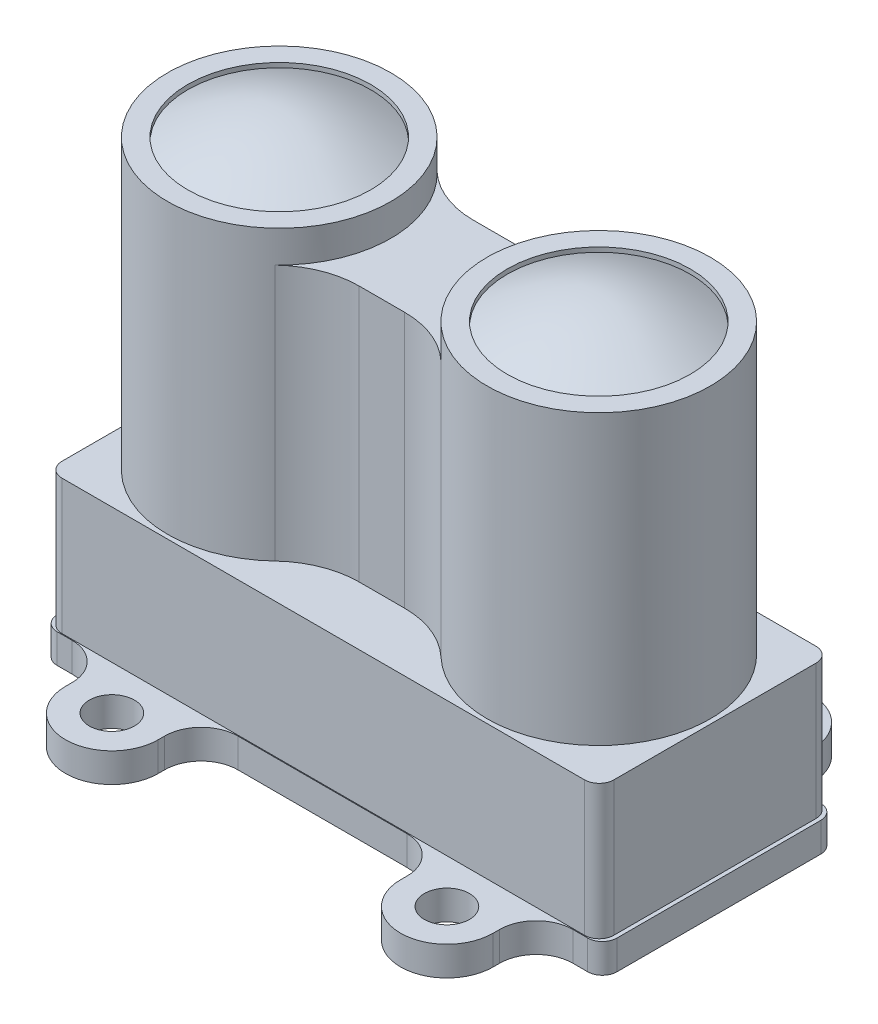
ISO-10303-21;
HEADER;
FILE_DESCRIPTION(('STEP AP214'),'2;1');
FILE_NAME('part.step','',(''),(''),'','','');
FILE_SCHEMA(('AUTOMOTIVE_DESIGN { 1 0 10303 214 1 1 1 1 }'));
ENDSEC;
DATA;
#1=APPLICATION_CONTEXT('core data for automotive mechanical design processes');
#2=APPLICATION_PROTOCOL_DEFINITION('international standard','automotive_design',2000,#1);
#3=PRODUCT_CONTEXT('',#1,'mechanical');
#4=PRODUCT('Part','Part','',(#3));
#5=PRODUCT_RELATED_PRODUCT_CATEGORY('part','',(#4));
#6=PRODUCT_DEFINITION_FORMATION('','',#4);
#7=PRODUCT_DEFINITION_CONTEXT('part definition',#1,'design');
#8=PRODUCT_DEFINITION('design','',#6,#7);
#9=PRODUCT_DEFINITION_SHAPE('','',#8);
#10=(LENGTH_UNIT() NAMED_UNIT(*) SI_UNIT(.MILLI.,.METRE.));
#11=(NAMED_UNIT(*) PLANE_ANGLE_UNIT() SI_UNIT($,.RADIAN.));
#12=(NAMED_UNIT(*) SI_UNIT($,.STERADIAN.) SOLID_ANGLE_UNIT());
#13=UNCERTAINTY_MEASURE_WITH_UNIT(LENGTH_MEASURE(1.E-05),#10,'distance_accuracy_value','');
#14=(GEOMETRIC_REPRESENTATION_CONTEXT(3) GLOBAL_UNCERTAINTY_ASSIGNED_CONTEXT((#13)) GLOBAL_UNIT_ASSIGNED_CONTEXT((#10,
#11,#12)) REPRESENTATION_CONTEXT('',''));
#15=CARTESIAN_POINT('',(0.,0.,0.));
#16=DIRECTION('',(0.,0.,1.));
#17=DIRECTION('',(1.,0.,0.));
#18=AXIS2_PLACEMENT_3D('',#15,#16,#17);
#19=CARTESIAN_POINT('',(-23.9522,11.684,-10.0457));
#20=DIRECTION('',(0.,1.,0.));
#21=DIRECTION('',(0.,0.,1.));
#22=AXIS2_PLACEMENT_3D('',#19,#20,#21);
#23=PLANE('',#22);
#24=CARTESIAN_POINT('',(-13.8684,11.684,0.));
#25=DIRECTION('',(0.,-1.,0.));
#26=DIRECTION('',(0.,0.,-1.));
#27=AXIS2_PLACEMENT_3D('',#24,#25,#26);
#28=CIRCLE('',#27,9.6901);
#29=CARTESIAN_POINT('',(-7.20803879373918,11.684,7.03829713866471));
#30=VERTEX_POINT('',#29);
#31=CARTESIAN_POINT('',(-7.20803879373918,11.684,-7.03829713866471));
#32=VERTEX_POINT('',#31);
#33=EDGE_CURVE('E1228',#30,#32,#28,.T.);
#34=ORIENTED_EDGE('',*,*,#33,.T.);
#35=CARTESIAN_POINT('',(-1.97053325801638,11.684,-12.573));
#36=DIRECTION('',(0.,1.,0.));
#37=DIRECTION('',(0.,0.,1.));
#38=AXIS2_PLACEMENT_3D('',#35,#36,#37);
#39=CIRCLE('',#38,7.62);
#40=CARTESIAN_POINT('',(-1.97053325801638,11.684,-4.953));
#41=VERTEX_POINT('',#40);
#42=EDGE_CURVE('E713',#32,#41,#39,.T.);
#43=ORIENTED_EDGE('',*,*,#42,.T.);
#44=DIRECTION('',(-1.,0.,0.));
#45=VECTOR('',#44,1.);
#46=CARTESIAN_POINT('',(-23.9522,11.684,-4.953));
#47=LINE('',#46,#45);
#48=CARTESIAN_POINT('',(1.97053325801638,11.684,-4.953));
#49=VERTEX_POINT('',#48);
#50=EDGE_CURVE('E2799',#49,#41,#47,.T.);
#51=ORIENTED_EDGE('',*,*,#50,.F.);
#52=CARTESIAN_POINT('',(1.97053325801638,11.684,-12.573));
#53=DIRECTION('',(0.,1.,0.));
#54=DIRECTION('',(0.,0.,1.));
#55=AXIS2_PLACEMENT_3D('',#52,#53,#54);
#56=CIRCLE('',#55,7.62);
#57=CARTESIAN_POINT('',(7.20803879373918,11.684,-7.03829713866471));
#58=VERTEX_POINT('',#57);
#59=EDGE_CURVE('E715',#49,#58,#56,.T.);
#60=ORIENTED_EDGE('',*,*,#59,.T.);
#61=CARTESIAN_POINT('',(13.8684,11.684,0.));
#62=DIRECTION('',(0.,-1.,0.));
#63=DIRECTION('',(0.,0.,-1.));
#64=AXIS2_PLACEMENT_3D('',#61,#62,#63);
#65=CIRCLE('',#64,9.6901);
#66=CARTESIAN_POINT('',(7.20803879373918,11.684,7.03829713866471));
#67=VERTEX_POINT('',#66);
#68=EDGE_CURVE('E1232',#58,#67,#65,.T.);
#69=ORIENTED_EDGE('',*,*,#68,.T.);
#70=CARTESIAN_POINT('',(1.97053325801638,11.684,12.573));
#71=DIRECTION('',(0.,1.,0.));
#72=DIRECTION('',(0.,0.,1.));
#73=AXIS2_PLACEMENT_3D('',#70,#71,#72);
#74=CIRCLE('',#73,7.62);
#75=CARTESIAN_POINT('',(1.97053325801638,11.684,4.953));
#76=VERTEX_POINT('',#75);
#77=EDGE_CURVE('E719',#67,#76,#74,.T.);
#78=ORIENTED_EDGE('',*,*,#77,.T.);
#79=DIRECTION('',(-1.,0.,0.));
#80=VECTOR('',#79,1.);
#81=CARTESIAN_POINT('',(-23.9522,11.684,4.953));
#82=LINE('',#81,#80);
#83=CARTESIAN_POINT('',(-1.97053325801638,11.684,4.953));
#84=VERTEX_POINT('',#83);
#85=EDGE_CURVE('E2806',#76,#84,#82,.T.);
#86=ORIENTED_EDGE('',*,*,#85,.T.);
#87=CARTESIAN_POINT('',(-1.97053325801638,11.684,12.573));
#88=DIRECTION('',(0.,1.,0.));
#89=DIRECTION('',(0.,0.,1.));
#90=AXIS2_PLACEMENT_3D('',#87,#88,#89);
#91=CIRCLE('',#90,7.62);
#92=EDGE_CURVE('E717',#84,#30,#91,.T.);
#93=ORIENTED_EDGE('',*,*,#92,.T.);
#94=EDGE_LOOP('',(#34,#43,#51,#60,#69,#78,#86,#93));
#95=FACE_BOUND('',#94,.T.);
#96=DIRECTION('',(0.,0.,1.));
#97=VECTOR('',#96,1.);
#98=CARTESIAN_POINT('',(23.9522,11.684,-10.0457));
#99=LINE('',#98,#97);
#100=CARTESIAN_POINT('',(23.9522,11.684,-8.7757));
#101=VERTEX_POINT('',#100);
#102=CARTESIAN_POINT('',(23.9522,11.684,8.7757));
#103=VERTEX_POINT('',#102);
#104=EDGE_CURVE('E2876',#101,#103,#99,.T.);
#105=ORIENTED_EDGE('',*,*,#104,.F.);
#106=CARTESIAN_POINT('',(22.6822,11.684,-8.7757));
#107=DIRECTION('',(0.,1.,0.));
#108=DIRECTION('',(0.,0.,1.));
#109=AXIS2_PLACEMENT_3D('',#106,#107,#108);
#110=CIRCLE('',#109,1.27);
#111=CARTESIAN_POINT('',(22.6822,11.684,-10.0457));
#112=VERTEX_POINT('',#111);
#113=EDGE_CURVE('E831',#101,#112,#110,.T.);
#114=ORIENTED_EDGE('',*,*,#113,.T.);
#115=DIRECTION('',(-1.,0.,0.));
#116=VECTOR('',#115,1.);
#117=CARTESIAN_POINT('',(0.,11.684,-10.0457));
#118=LINE('',#117,#116);
#119=CARTESIAN_POINT('',(-22.6822,11.684,-10.0457));
#120=VERTEX_POINT('',#119);
#121=EDGE_CURVE('E965',#112,#120,#118,.T.);
#122=ORIENTED_EDGE('',*,*,#121,.T.);
#123=CARTESIAN_POINT('',(-22.6822,11.684,-8.7757));
#124=DIRECTION('',(0.,1.,0.));
#125=DIRECTION('',(0.,0.,1.));
#126=AXIS2_PLACEMENT_3D('',#123,#124,#125);
#127=CIRCLE('',#126,1.27);
#128=CARTESIAN_POINT('',(-23.9522,11.684,-8.7757));
#129=VERTEX_POINT('',#128);
#130=EDGE_CURVE('E833',#120,#129,#127,.T.);
#131=ORIENTED_EDGE('',*,*,#130,.T.);
#132=DIRECTION('',(0.,0.,-1.));
#133=VECTOR('',#132,1.);
#134=CARTESIAN_POINT('',(-23.9522,11.684,13.8556999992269));
#135=LINE('',#134,#133);
#136=CARTESIAN_POINT('',(-23.9522,11.684,8.7757));
#137=VERTEX_POINT('',#136);
#138=EDGE_CURVE('E2870',#137,#129,#135,.T.);
#139=ORIENTED_EDGE('',*,*,#138,.F.);
#140=CARTESIAN_POINT('',(-22.6822,11.684,8.7757));
#141=DIRECTION('',(0.,1.,0.));
#142=DIRECTION('',(0.,0.,1.));
#143=AXIS2_PLACEMENT_3D('',#140,#141,#142);
#144=CIRCLE('',#143,1.27);
#145=CARTESIAN_POINT('',(-22.6822,11.684,10.0457));
#146=VERTEX_POINT('',#145);
#147=EDGE_CURVE('E837',#137,#146,#144,.T.);
#148=ORIENTED_EDGE('',*,*,#147,.T.);
#149=DIRECTION('',(-1.,0.,0.));
#150=VECTOR('',#149,1.);
#151=CARTESIAN_POINT('',(23.9522,11.684,10.0457));
#152=LINE('',#151,#150);
#153=CARTESIAN_POINT('',(22.6822,11.684,10.0457));
#154=VERTEX_POINT('',#153);
#155=EDGE_CURVE('E2846',#154,#146,#152,.T.);
#156=ORIENTED_EDGE('',*,*,#155,.F.);
#157=CARTESIAN_POINT('',(22.6822,11.684,8.7757));
#158=DIRECTION('',(0.,1.,0.));
#159=DIRECTION('',(0.,0.,1.));
#160=AXIS2_PLACEMENT_3D('',#157,#158,#159);
#161=CIRCLE('',#160,1.27);
#162=EDGE_CURVE('E835',#154,#103,#161,.T.);
#163=ORIENTED_EDGE('',*,*,#162,.T.);
#164=EDGE_LOOP('',(#105,#114,#122,#131,#139,#148,#156,#163));
#165=FACE_BOUND('',#164,.T.);
#166=ADVANCED_FACE('F53',(#95,#165),#23,.T.);
#167=CARTESIAN_POINT('',(23.9522,0.,0.));
#168=DIRECTION('',(1.,0.,0.));
#169=DIRECTION('',(0.,0.,-1.));
#170=AXIS2_PLACEMENT_3D('',#167,#168,#169);
#171=PLANE('',#170);
#172=DIRECTION('',(0.,0.,-1.));
#173=VECTOR('',#172,1.);
#174=CARTESIAN_POINT('',(23.9522,0.,13.8556999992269));
#175=LINE('',#174,#173);
#176=CARTESIAN_POINT('',(23.9522,0.,8.7757));
#177=VERTEX_POINT('',#176);
#178=CARTESIAN_POINT('',(23.9522,0.,-8.77569999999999));
#179=VERTEX_POINT('',#178);
#180=EDGE_CURVE('E2873',#177,#179,#175,.T.);
#181=ORIENTED_EDGE('',*,*,#180,.T.);
#182=DIRECTION('',(0.,1.,0.));
#183=VECTOR('',#182,1.);
#184=CARTESIAN_POINT('',(23.9522,11.684,-8.7757));
#185=LINE('',#184,#183);
#186=EDGE_CURVE('E839',#179,#101,#185,.T.);
#187=ORIENTED_EDGE('',*,*,#186,.T.);
#188=ORIENTED_EDGE('',*,*,#104,.T.);
#189=DIRECTION('',(0.,1.,0.));
#190=VECTOR('',#189,1.);
#191=CARTESIAN_POINT('',(23.9522,0.,8.7757));
#192=LINE('',#191,#190);
#193=EDGE_CURVE('E842',#103,#177,#192,.F.);
#194=ORIENTED_EDGE('',*,*,#193,.T.);
#195=EDGE_LOOP('',(#181,#187,#188,#194));
#196=FACE_BOUND('',#195,.T.);
#197=ADVANCED_FACE('F588',(#196),#171,.T.);
#198=CARTESIAN_POINT('',(-23.9522,0.,0.));
#199=DIRECTION('',(-1.,0.,0.));
#200=DIRECTION('',(0.,0.,1.));
#201=AXIS2_PLACEMENT_3D('',#198,#199,#200);
#202=PLANE('',#201);
#203=ORIENTED_EDGE('',*,*,#138,.T.);
#204=DIRECTION('',(0.,-1.,0.));
#205=VECTOR('',#204,1.);
#206=CARTESIAN_POINT('',(-23.9522,0.,-8.7757));
#207=LINE('',#206,#205);
#208=CARTESIAN_POINT('',(-23.9522,0.,-8.7757));
#209=VERTEX_POINT('',#208);
#210=EDGE_CURVE('E819',#129,#209,#207,.T.);
#211=ORIENTED_EDGE('',*,*,#210,.T.);
#212=DIRECTION('',(0.,0.,1.));
#213=VECTOR('',#212,1.);
#214=CARTESIAN_POINT('',(-23.9522,0.,-10.0457));
#215=LINE('',#214,#213);
#216=CARTESIAN_POINT('',(-23.9522,0.,8.7757));
#217=VERTEX_POINT('',#216);
#218=EDGE_CURVE('E2866',#209,#217,#215,.T.);
#219=ORIENTED_EDGE('',*,*,#218,.T.);
#220=DIRECTION('',(0.,-1.,0.));
#221=VECTOR('',#220,1.);
#222=CARTESIAN_POINT('',(-23.9522,0.,8.7757));
#223=LINE('',#222,#221);
#224=EDGE_CURVE('E822',#217,#137,#223,.F.);
#225=ORIENTED_EDGE('',*,*,#224,.T.);
#226=EDGE_LOOP('',(#203,#211,#219,#225));
#227=FACE_BOUND('',#226,.T.);
#228=ADVANCED_FACE('F596',(#227),#202,.T.);
#229=CARTESIAN_POINT('',(24.2951,0.,0.));
#230=DIRECTION('',(1.,0.,0.));
#231=DIRECTION('',(0.,0.,-1.));
#232=AXIS2_PLACEMENT_3D('',#229,#230,#231);
#233=PLANE('',#232);
#234=DIRECTION('',(0.,0.,-1.));
#235=VECTOR('',#234,1.);
#236=CARTESIAN_POINT('',(24.2951,-2.54,-13.8557000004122));
#237=LINE('',#236,#235);
#238=CARTESIAN_POINT('',(24.2951,-2.54,8.84555));
#239=VERTEX_POINT('',#238);
#240=CARTESIAN_POINT('',(24.2951,-2.54,-8.84555000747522));
#241=VERTEX_POINT('',#240);
#242=EDGE_CURVE('E2888',#239,#241,#237,.T.);
#243=ORIENTED_EDGE('',*,*,#242,.T.);
#244=DIRECTION('',(0.,-1.,0.));
#245=VECTOR('',#244,1.);
#246=CARTESIAN_POINT('',(24.2951,0.,-8.84555000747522));
#247=LINE('',#246,#245);
#248=CARTESIAN_POINT('',(24.2951,0.,-8.84555000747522));
#249=VERTEX_POINT('',#248);
#250=EDGE_CURVE('E844',#241,#249,#247,.F.);
#251=ORIENTED_EDGE('',*,*,#250,.T.);
#252=DIRECTION('',(0.,0.,1.));
#253=VECTOR('',#252,1.);
#254=CARTESIAN_POINT('',(24.2951,0.,-10.0457));
#255=LINE('',#254,#253);
#256=CARTESIAN_POINT('',(24.2951,0.,8.84555));
#257=VERTEX_POINT('',#256);
#258=EDGE_CURVE('E2896',#249,#257,#255,.T.);
#259=ORIENTED_EDGE('',*,*,#258,.T.);
#260=DIRECTION('',(0.,-1.,0.));
#261=VECTOR('',#260,1.);
#262=CARTESIAN_POINT('',(24.2951,-2.54,8.84555));
#263=LINE('',#262,#261);
#264=EDGE_CURVE('E846',#257,#239,#263,.T.);
#265=ORIENTED_EDGE('',*,*,#264,.T.);
#266=EDGE_LOOP('',(#243,#251,#259,#265));
#267=FACE_BOUND('',#266,.T.);
#268=ADVANCED_FACE('F2732',(#267),#233,.T.);
#269=CARTESIAN_POINT('',(-24.2951,0.,0.));
#270=DIRECTION('',(1.,0.,0.));
#271=DIRECTION('',(0.,0.,-1.));
#272=AXIS2_PLACEMENT_3D('',#269,#270,#271);
#273=PLANE('',#272);
#274=DIRECTION('',(0.,0.,-1.));
#275=VECTOR('',#274,1.);
#276=CARTESIAN_POINT('',(-24.2951,0.,-13.8557000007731));
#277=LINE('',#276,#275);
#278=CARTESIAN_POINT('',(-24.2951,0.,8.84555));
#279=VERTEX_POINT('',#278);
#280=CARTESIAN_POINT('',(-24.2951,0.,-8.84555));
#281=VERTEX_POINT('',#280);
#282=EDGE_CURVE('E2902',#279,#281,#277,.T.);
#283=ORIENTED_EDGE('',*,*,#282,.T.);
#284=DIRECTION('',(0.,1.,0.));
#285=VECTOR('',#284,1.);
#286=CARTESIAN_POINT('',(-24.2951,-2.54,-8.84555));
#287=LINE('',#286,#285);
#288=CARTESIAN_POINT('',(-24.2951,-2.54,-8.84555));
#289=VERTEX_POINT('',#288);
#290=EDGE_CURVE('E863',#281,#289,#287,.F.);
#291=ORIENTED_EDGE('',*,*,#290,.T.);
#292=DIRECTION('',(0.,0.,1.));
#293=VECTOR('',#292,1.);
#294=CARTESIAN_POINT('',(-24.2951,-2.54,10.11555));
#295=LINE('',#294,#293);
#296=CARTESIAN_POINT('',(-24.2951,-2.54,8.84555));
#297=VERTEX_POINT('',#296);
#298=EDGE_CURVE('E2899',#289,#297,#295,.T.);
#299=ORIENTED_EDGE('',*,*,#298,.T.);
#300=DIRECTION('',(0.,1.,0.));
#301=VECTOR('',#300,1.);
#302=CARTESIAN_POINT('',(-24.2951,0.,8.84555));
#303=LINE('',#302,#301);
#304=EDGE_CURVE('E865',#297,#279,#303,.T.);
#305=ORIENTED_EDGE('',*,*,#304,.T.);
#306=EDGE_LOOP('',(#283,#291,#299,#305));
#307=FACE_BOUND('',#306,.T.);
#308=ADVANCED_FACE('F2729',(#307),#273,.F.);
#309=CARTESIAN_POINT('',(-22.6822,0.,-10.0457));
#310=DIRECTION('',(0.,0.,1.));
#311=DIRECTION('',(1.,0.,0.));
#312=AXIS2_PLACEMENT_3D('',#309,#310,#311);
#313=PLANE('',#312);
#314=DIRECTION('',(0.,-1.,0.));
#315=VECTOR('',#314,1.);
#316=CARTESIAN_POINT('',(-22.6822,11.684,-10.0457));
#317=LINE('',#316,#315);
#318=CARTESIAN_POINT('',(-22.6822,0.,-10.0457));
#319=VERTEX_POINT('',#318);
#320=EDGE_CURVE('E828',#319,#120,#317,.F.);
#321=ORIENTED_EDGE('',*,*,#320,.T.);
#322=ORIENTED_EDGE('',*,*,#121,.F.);
#323=DIRECTION('',(0.,1.,0.));
#324=VECTOR('',#323,1.);
#325=CARTESIAN_POINT('',(22.6822,0.,-10.0457));
#326=LINE('',#325,#324);
#327=CARTESIAN_POINT('',(22.6822,0.,-10.0457));
#328=VERTEX_POINT('',#327);
#329=EDGE_CURVE('E826',#112,#328,#326,.F.);
#330=ORIENTED_EDGE('',*,*,#329,.T.);
#331=DIRECTION('',(1.,0.,0.));
#332=VECTOR('',#331,1.);
#333=CARTESIAN_POINT('',(0.,0.,-10.0457));
#334=LINE('',#333,#332);
#335=EDGE_CURVE('E957',#319,#328,#334,.T.);
#336=ORIENTED_EDGE('',*,*,#335,.F.);
#337=EDGE_LOOP('',(#321,#322,#330,#336));
#338=FACE_BOUND('',#337,.T.);
#339=ADVANCED_FACE('F603',(#338),#313,.F.);
#340=CARTESIAN_POINT('',(18.56105,-2.54,13.29055));
#341=DIRECTION('',(-1.,0.,0.));
#342=DIRECTION('',(0.,0.,1.));
#343=AXIS2_PLACEMENT_3D('',#340,#341,#342);
#344=PLANE('',#343);
#345=DIRECTION('',(0.,0.,-1.));
#346=VECTOR('',#345,1.);
#347=CARTESIAN_POINT('',(18.5610499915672,-2.54,0.));
#348=LINE('',#347,#346);
#349=CARTESIAN_POINT('',(18.5610499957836,-2.54,13.8556999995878));
#350=VERTEX_POINT('',#349);
#351=CARTESIAN_POINT('',(18.5610499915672,-2.54,13.29055));
#352=VERTEX_POINT('',#351);
#353=EDGE_CURVE('E390',#350,#352,#348,.T.);
#354=ORIENTED_EDGE('',*,*,#353,.T.);
#355=DIRECTION('',(0.,-1.,0.));
#356=VECTOR('',#355,1.);
#357=CARTESIAN_POINT('',(18.56105,0.,13.29055));
#358=LINE('',#357,#356);
#359=CARTESIAN_POINT('',(18.56105,0.,13.29055));
#360=VERTEX_POINT('',#359);
#361=EDGE_CURVE('E763',#352,#360,#358,.F.);
#362=ORIENTED_EDGE('',*,*,#361,.T.);
#363=DIRECTION('',(0.,0.,-1.));
#364=VECTOR('',#363,1.);
#365=CARTESIAN_POINT('',(18.56105,0.,10.11555));
#366=LINE('',#365,#364);
#367=CARTESIAN_POINT('',(18.56105,0.,13.8556999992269));
#368=VERTEX_POINT('',#367);
#369=EDGE_CURVE('E2905',#368,#360,#366,.T.);
#370=ORIENTED_EDGE('',*,*,#369,.F.);
#371=DIRECTION('',(0.,1.,0.));
#372=VECTOR('',#371,1.);
#373=CARTESIAN_POINT('',(18.56105,-1.27,13.8556999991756));
#374=LINE('',#373,#372);
#375=EDGE_CURVE('E881',#368,#350,#374,.F.);
#376=ORIENTED_EDGE('',*,*,#375,.T.);
#377=EDGE_LOOP('',(#354,#362,#370,#376));
#378=FACE_BOUND('',#377,.T.);
#379=ADVANCED_FACE('F2935',(#378),#344,.F.);
#380=CARTESIAN_POINT('',(-18.56105,-2.54,13.8557));
#381=DIRECTION('',(1.,0.,0.));
#382=DIRECTION('',(0.,0.,-1.));
#383=AXIS2_PLACEMENT_3D('',#380,#381,#382);
#384=PLANE('',#383);
#385=DIRECTION('',(0.,0.,1.));
#386=VECTOR('',#385,1.);
#387=CARTESIAN_POINT('',(-18.56105,0.,13.8556999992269));
#388=LINE('',#387,#386);
#389=CARTESIAN_POINT('',(-18.56105,0.,13.29055));
#390=VERTEX_POINT('',#389);
#391=CARTESIAN_POINT('',(-18.56105,0.,13.8556999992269));
#392=VERTEX_POINT('',#391);
#393=EDGE_CURVE('E358',#390,#392,#388,.T.);
#394=ORIENTED_EDGE('',*,*,#393,.F.);
#395=DIRECTION('',(0.,1.,0.));
#396=VECTOR('',#395,1.);
#397=CARTESIAN_POINT('',(-18.56105,-2.54,13.29055));
#398=LINE('',#397,#396);
#399=CARTESIAN_POINT('',(-18.5610499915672,-2.54,13.29055));
#400=VERTEX_POINT('',#399);
#401=EDGE_CURVE('E786',#390,#400,#398,.F.);
#402=ORIENTED_EDGE('',*,*,#401,.T.);
#403=DIRECTION('',(0.,0.,1.));
#404=VECTOR('',#403,1.);
#405=CARTESIAN_POINT('',(-18.5610499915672,-2.54,0.));
#406=LINE('',#405,#404);
#407=CARTESIAN_POINT('',(-18.5610499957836,-2.54,13.8556999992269));
#408=VERTEX_POINT('',#407);
#409=EDGE_CURVE('E387',#400,#408,#406,.T.);
#410=ORIENTED_EDGE('',*,*,#409,.T.);
#411=DIRECTION('',(0.,-1.,0.));
#412=VECTOR('',#411,1.);
#413=CARTESIAN_POINT('',(-18.56105,-1.27,13.8556999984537));
#414=LINE('',#413,#412);
#415=EDGE_CURVE('E378',#408,#392,#414,.F.);
#416=ORIENTED_EDGE('',*,*,#415,.T.);
#417=EDGE_LOOP('',(#394,#402,#410,#416));
#418=FACE_BOUND('',#417,.T.);
#419=ADVANCED_FACE('F385',(#418),#384,.F.);
#420=CARTESIAN_POINT('',(-24.2951,0.,-18.089753));
#421=DIRECTION('',(0.,1.,0.));
#422=DIRECTION('',(0.,0.,1.));
#423=AXIS2_PLACEMENT_3D('',#420,#421,#422);
#424=PLANE('',#423);
#425=ORIENTED_EDGE('',*,*,#218,.F.);
#426=CARTESIAN_POINT('',(-22.6822,0.,-8.7757));
#427=DIRECTION('',(0.,1.,0.));
#428=DIRECTION('',(0.,0.,1.));
#429=AXIS2_PLACEMENT_3D('',#426,#427,#428);
#430=CIRCLE('',#429,1.27);
#431=EDGE_CURVE('E809',#209,#319,#430,.F.);
#432=ORIENTED_EDGE('',*,*,#431,.T.);
#433=ORIENTED_EDGE('',*,*,#335,.T.);
#434=CARTESIAN_POINT('',(22.6822,0.,-8.7757));
#435=DIRECTION('',(0.,1.,0.));
#436=DIRECTION('',(0.,0.,1.));
#437=AXIS2_PLACEMENT_3D('',#434,#435,#436);
#438=CIRCLE('',#437,1.27);
#439=EDGE_CURVE('E811',#328,#179,#438,.F.);
#440=ORIENTED_EDGE('',*,*,#439,.T.);
#441=ORIENTED_EDGE('',*,*,#180,.F.);
#442=CARTESIAN_POINT('',(22.6822,0.,8.7757));
#443=DIRECTION('',(0.,1.,0.));
#444=DIRECTION('',(0.,0.,1.));
#445=AXIS2_PLACEMENT_3D('',#442,#443,#444);
#446=CIRCLE('',#445,1.27);
#447=CARTESIAN_POINT('',(22.6822,0.,10.0457));
#448=VERTEX_POINT('',#447);
#449=EDGE_CURVE('E807',#177,#448,#446,.F.);
#450=ORIENTED_EDGE('',*,*,#449,.T.);
#451=DIRECTION('',(1.,0.,0.));
#452=VECTOR('',#451,1.);
#453=CARTESIAN_POINT('',(-23.9522,0.,10.0457));
#454=LINE('',#453,#452);
#455=CARTESIAN_POINT('',(-22.6822,0.,10.0457));
#456=VERTEX_POINT('',#455);
#457=EDGE_CURVE('E2843',#456,#448,#454,.T.);
#458=ORIENTED_EDGE('',*,*,#457,.F.);
#459=CARTESIAN_POINT('',(-22.6822,0.,8.7757));
#460=DIRECTION('',(0.,1.,0.));
#461=DIRECTION('',(0.,0.,1.));
#462=AXIS2_PLACEMENT_3D('',#459,#460,#461);
#463=CIRCLE('',#462,1.27);
#464=EDGE_CURVE('E805',#456,#217,#463,.F.);
#465=ORIENTED_EDGE('',*,*,#464,.T.);
#466=EDGE_LOOP('',(#425,#432,#433,#440,#441,#450,#458,#465));
#467=FACE_BOUND('',#466,.T.);
#468=DIRECTION('',(1.,0.,0.));
#469=VECTOR('',#468,1.);
#470=CARTESIAN_POINT('',(-24.2951,0.,-10.11555));
#471=LINE('',#470,#469);
#472=CARTESIAN_POINT('',(-23.0251,0.,-10.11555));
#473=VERTEX_POINT('',#472);
#474=CARTESIAN_POINT('',(-21.73605,0.,-10.11555));
#475=VERTEX_POINT('',#474);
#476=EDGE_CURVE('E2857',#473,#475,#471,.T.);
#477=ORIENTED_EDGE('',*,*,#476,.F.);
#478=CARTESIAN_POINT('',(-23.0251,0.,-8.84555));
#479=DIRECTION('',(0.,1.,0.));
#480=DIRECTION('',(0.,0.,1.));
#481=AXIS2_PLACEMENT_3D('',#478,#479,#480);
#482=CIRCLE('',#481,1.27);
#483=EDGE_CURVE('E796',#473,#281,#482,.T.);
#484=ORIENTED_EDGE('',*,*,#483,.T.);
#485=ORIENTED_EDGE('',*,*,#282,.F.);
#486=CARTESIAN_POINT('',(-23.0251,0.,8.84555));
#487=DIRECTION('',(0.,1.,0.));
#488=DIRECTION('',(0.,0.,1.));
#489=AXIS2_PLACEMENT_3D('',#486,#487,#488);
#490=CIRCLE('',#489,1.27);
#491=CARTESIAN_POINT('',(-23.0251,0.,10.11555));
#492=VERTEX_POINT('',#491);
#493=EDGE_CURVE('E798',#279,#492,#490,.T.);
#494=ORIENTED_EDGE('',*,*,#493,.T.);
#495=DIRECTION('',(1.,0.,0.));
#496=VECTOR('',#495,1.);
#497=CARTESIAN_POINT('',(-23.5585,0.,10.11555));
#498=LINE('',#497,#496);
#499=CARTESIAN_POINT('',(-21.73605,0.,10.11555));
#500=VERTEX_POINT('',#499);
#501=EDGE_CURVE('E371',#492,#500,#498,.T.);
#502=ORIENTED_EDGE('',*,*,#501,.T.);
#503=CARTESIAN_POINT('',(-21.73605,0.,13.29055));
#504=DIRECTION('',(0.,1.,0.));
#505=DIRECTION('',(0.,0.,1.));
#506=AXIS2_PLACEMENT_3D('',#503,#504,#505);
#507=CIRCLE('',#506,3.175);
#508=EDGE_CURVE('E367',#500,#390,#507,.F.);
#509=ORIENTED_EDGE('',*,*,#508,.T.);
#510=ORIENTED_EDGE('',*,*,#393,.T.);
#511=CARTESIAN_POINT('',(-14.5415,0.,13.8557));
#512=DIRECTION('',(0.,1.,0.));
#513=DIRECTION('',(0.,0.,1.));
#514=AXIS2_PLACEMENT_3D('',#511,#512,#513);
#515=CIRCLE('',#514,4.01955000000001);
#516=CARTESIAN_POINT('',(-10.52195,0.,13.8556999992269));
#517=VERTEX_POINT('',#516);
#518=EDGE_CURVE('E364',#392,#517,#515,.T.);
#519=ORIENTED_EDGE('',*,*,#518,.T.);
#520=DIRECTION('',(0.,0.,1.));
#521=VECTOR('',#520,1.);
#522=CARTESIAN_POINT('',(-10.52195,0.,10.11555));
#523=LINE('',#522,#521);
#524=CARTESIAN_POINT('',(-10.52195,0.,13.29055));
#525=VERTEX_POINT('',#524);
#526=EDGE_CURVE('E2925',#525,#517,#523,.T.);
#527=ORIENTED_EDGE('',*,*,#526,.F.);
#528=CARTESIAN_POINT('',(-7.34695,0.,13.29055));
#529=DIRECTION('',(0.,1.,0.));
#530=DIRECTION('',(0.,0.,1.));
#531=AXIS2_PLACEMENT_3D('',#528,#529,#530);
#532=CIRCLE('',#531,3.175);
#533=CARTESIAN_POINT('',(-7.34695,0.,10.11555));
#534=VERTEX_POINT('',#533);
#535=EDGE_CURVE('E741',#525,#534,#532,.F.);
#536=ORIENTED_EDGE('',*,*,#535,.T.);
#537=DIRECTION('',(-1.,0.,0.));
#538=VECTOR('',#537,1.);
#539=CARTESIAN_POINT('',(10.52195,0.,10.11555));
#540=LINE('',#539,#538);
#541=CARTESIAN_POINT('',(7.34695,0.,10.11555));
#542=VERTEX_POINT('',#541);
#543=EDGE_CURVE('E2916',#542,#534,#540,.T.);
#544=ORIENTED_EDGE('',*,*,#543,.F.);
#545=CARTESIAN_POINT('',(7.34695,0.,13.29055));
#546=DIRECTION('',(0.,1.,0.));
#547=DIRECTION('',(0.,0.,1.));
#548=AXIS2_PLACEMENT_3D('',#545,#546,#547);
#549=CIRCLE('',#548,3.175);
#550=CARTESIAN_POINT('',(10.52195,0.,13.29055));
#551=VERTEX_POINT('',#550);
#552=EDGE_CURVE('E747',#542,#551,#549,.F.);
#553=ORIENTED_EDGE('',*,*,#552,.T.);
#554=DIRECTION('',(0.,0.,1.));
#555=VECTOR('',#554,1.);
#556=CARTESIAN_POINT('',(10.52195,0.,10.11555));
#557=LINE('',#556,#555);
#558=CARTESIAN_POINT('',(10.52195,0.,13.8556999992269));
#559=VERTEX_POINT('',#558);
#560=EDGE_CURVE('E916',#551,#559,#557,.T.);
#561=ORIENTED_EDGE('',*,*,#560,.T.);
#562=CARTESIAN_POINT('',(14.5415,0.,13.8557));
#563=DIRECTION('',(0.,1.,0.));
#564=DIRECTION('',(0.,0.,1.));
#565=AXIS2_PLACEMENT_3D('',#562,#563,#564);
#566=CIRCLE('',#565,4.01955000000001);
#567=EDGE_CURVE('E382',#559,#368,#566,.T.);
#568=ORIENTED_EDGE('',*,*,#567,.T.);
#569=ORIENTED_EDGE('',*,*,#369,.T.);
#570=CARTESIAN_POINT('',(21.73605,0.,13.29055));
#571=DIRECTION('',(0.,1.,0.));
#572=DIRECTION('',(0.,0.,1.));
#573=AXIS2_PLACEMENT_3D('',#570,#571,#572);
#574=CIRCLE('',#573,3.175);
#575=CARTESIAN_POINT('',(21.73605,0.,10.11555));
#576=VERTEX_POINT('',#575);
#577=EDGE_CURVE('E733',#360,#576,#574,.F.);
#578=ORIENTED_EDGE('',*,*,#577,.T.);
#579=DIRECTION('',(-1.,0.,0.));
#580=VECTOR('',#579,1.);
#581=CARTESIAN_POINT('',(23.5585,0.,10.11555));
#582=LINE('',#581,#580);
#583=CARTESIAN_POINT('',(23.0251,0.,10.11555));
#584=VERTEX_POINT('',#583);
#585=EDGE_CURVE('E372',#584,#576,#582,.T.);
#586=ORIENTED_EDGE('',*,*,#585,.F.);
#587=CARTESIAN_POINT('',(23.0251,0.,8.84555));
#588=DIRECTION('',(0.,1.,0.));
#589=DIRECTION('',(0.,0.,1.));
#590=AXIS2_PLACEMENT_3D('',#587,#588,#589);
#591=CIRCLE('',#590,1.27);
#592=EDGE_CURVE('E803',#584,#257,#591,.T.);
#593=ORIENTED_EDGE('',*,*,#592,.T.);
#594=ORIENTED_EDGE('',*,*,#258,.F.);
#595=CARTESIAN_POINT('',(23.0251,0.,-8.84555000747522));
#596=DIRECTION('',(0.,1.,0.));
#597=DIRECTION('',(0.,0.,1.));
#598=AXIS2_PLACEMENT_3D('',#595,#596,#597);
#599=CIRCLE('',#598,1.27);
#600=CARTESIAN_POINT('',(23.0251,0.,-10.1155500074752));
#601=VERTEX_POINT('',#600);
#602=EDGE_CURVE('E800',#249,#601,#599,.T.);
#603=ORIENTED_EDGE('',*,*,#602,.T.);
#604=DIRECTION('',(1.,0.,0.));
#605=VECTOR('',#604,1.);
#606=CARTESIAN_POINT('',(18.56105,0.,-10.1155500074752));
#607=LINE('',#606,#605);
#608=CARTESIAN_POINT('',(21.73605,0.,-10.1155500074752));
#609=VERTEX_POINT('',#608);
#610=EDGE_CURVE('E2849',#609,#601,#607,.T.);
#611=ORIENTED_EDGE('',*,*,#610,.F.);
#612=CARTESIAN_POINT('',(21.73605,0.,-13.2905500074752));
#613=DIRECTION('',(0.,1.,0.));
#614=DIRECTION('',(0.,0.,1.));
#615=AXIS2_PLACEMENT_3D('',#612,#613,#614);
#616=CIRCLE('',#615,3.175);
#617=CARTESIAN_POINT('',(18.56105,0.,-13.2905500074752));
#618=VERTEX_POINT('',#617);
#619=EDGE_CURVE('E731',#609,#618,#616,.F.);
#620=ORIENTED_EDGE('',*,*,#619,.T.);
#621=DIRECTION('',(0.,0.,-1.));
#622=VECTOR('',#621,1.);
#623=CARTESIAN_POINT('',(18.56105,0.,-10.1155500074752));
#624=LINE('',#623,#622);
#625=CARTESIAN_POINT('',(18.56105,0.,-13.8557000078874));
#626=VERTEX_POINT('',#625);
#627=EDGE_CURVE('E2854',#618,#626,#624,.T.);
#628=ORIENTED_EDGE('',*,*,#627,.T.);
#629=CARTESIAN_POINT('',(14.5415,0.,-13.8557));
#630=DIRECTION('',(0.,1.,0.));
#631=DIRECTION('',(0.,0.,1.));
#632=AXIS2_PLACEMENT_3D('',#629,#630,#631);
#633=CIRCLE('',#632,4.01955);
#634=CARTESIAN_POINT('',(10.52195,0.,-13.8557000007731));
#635=VERTEX_POINT('',#634);
#636=EDGE_CURVE('E925',#626,#635,#633,.T.);
#637=ORIENTED_EDGE('',*,*,#636,.T.);
#638=DIRECTION('',(0.,0.,-1.));
#639=VECTOR('',#638,1.);
#640=CARTESIAN_POINT('',(10.52195,0.,-10.11555));
#641=LINE('',#640,#639);
#642=CARTESIAN_POINT('',(10.52195,0.,-13.29055));
#643=VERTEX_POINT('',#642);
#644=EDGE_CURVE('E2891',#643,#635,#641,.T.);
#645=ORIENTED_EDGE('',*,*,#644,.F.);
#646=CARTESIAN_POINT('',(7.34695,0.,-13.29055));
#647=DIRECTION('',(0.,1.,0.));
#648=DIRECTION('',(0.,0.,1.));
#649=AXIS2_PLACEMENT_3D('',#646,#647,#648);
#650=CIRCLE('',#649,3.175);
#651=CARTESIAN_POINT('',(7.34695,0.,-10.11555));
#652=VERTEX_POINT('',#651);
#653=EDGE_CURVE('E737',#643,#652,#650,.F.);
#654=ORIENTED_EDGE('',*,*,#653,.T.);
#655=DIRECTION('',(1.,0.,0.));
#656=VECTOR('',#655,1.);
#657=CARTESIAN_POINT('',(-10.52195,0.,-10.11555));
#658=LINE('',#657,#656);
#659=CARTESIAN_POINT('',(-7.34695,0.,-10.11555));
#660=VERTEX_POINT('',#659);
#661=EDGE_CURVE('E2879',#660,#652,#658,.T.);
#662=ORIENTED_EDGE('',*,*,#661,.F.);
#663=CARTESIAN_POINT('',(-7.34695,0.,-13.29055));
#664=DIRECTION('',(0.,1.,0.));
#665=DIRECTION('',(0.,0.,1.));
#666=AXIS2_PLACEMENT_3D('',#663,#664,#665);
#667=CIRCLE('',#666,3.175);
#668=CARTESIAN_POINT('',(-10.52195,0.,-13.29055));
#669=VERTEX_POINT('',#668);
#670=EDGE_CURVE('E727',#660,#669,#667,.F.);
#671=ORIENTED_EDGE('',*,*,#670,.T.);
#672=DIRECTION('',(0.,0.,-1.));
#673=VECTOR('',#672,1.);
#674=CARTESIAN_POINT('',(-10.52195,0.,-10.11555));
#675=LINE('',#674,#673);
#676=CARTESIAN_POINT('',(-10.52195,0.,-13.8557000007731));
#677=VERTEX_POINT('',#676);
#678=EDGE_CURVE('E2885',#669,#677,#675,.T.);
#679=ORIENTED_EDGE('',*,*,#678,.T.);
#680=CARTESIAN_POINT('',(-14.5415,0.,-13.8557));
#681=DIRECTION('',(0.,1.,0.));
#682=DIRECTION('',(0.,0.,1.));
#683=AXIS2_PLACEMENT_3D('',#680,#681,#682);
#684=CIRCLE('',#683,4.01955);
#685=CARTESIAN_POINT('',(-18.56105,0.,-13.8557000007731));
#686=VERTEX_POINT('',#685);
#687=EDGE_CURVE('E930',#677,#686,#684,.T.);
#688=ORIENTED_EDGE('',*,*,#687,.T.);
#689=DIRECTION('',(0.,0.,-1.));
#690=VECTOR('',#689,1.);
#691=CARTESIAN_POINT('',(-18.56105,0.,-10.11555));
#692=LINE('',#691,#690);
#693=CARTESIAN_POINT('',(-18.56105,0.,-13.29055));
#694=VERTEX_POINT('',#693);
#695=EDGE_CURVE('E2863',#694,#686,#692,.T.);
#696=ORIENTED_EDGE('',*,*,#695,.F.);
#697=CARTESIAN_POINT('',(-21.73605,0.,-13.29055));
#698=DIRECTION('',(0.,1.,0.));
#699=DIRECTION('',(0.,0.,1.));
#700=AXIS2_PLACEMENT_3D('',#697,#698,#699);
#701=CIRCLE('',#700,3.175);
#702=EDGE_CURVE('E752',#694,#475,#701,.F.);
#703=ORIENTED_EDGE('',*,*,#702,.T.);
#704=EDGE_LOOP('',(#477,#484,#485,#494,#502,#509,#510,#519,#527,#536,#544,#553,#561,#568,#569,
#578,#586,#593,#594,#603,#611,#620,#628,#637,#645,#654,#662,#671,#679,#688,#696,#703));
#705=FACE_BOUND('',#704,.T.);
#706=CARTESIAN_POINT('',(14.5415,0.,-13.8557));
#707=DIRECTION('',(0.,1.,0.));
#708=DIRECTION('',(0.,0.,1.));
#709=AXIS2_PLACEMENT_3D('',#706,#707,#708);
#710=CIRCLE('',#709,1.95579999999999);
#711=CARTESIAN_POINT('',(14.5415,0.,-11.8999));
#712=VERTEX_POINT('',#711);
#713=EDGE_CURVE('E2825',#712,#712,#710,.T.);
#714=ORIENTED_EDGE('',*,*,#713,.F.);
#715=EDGE_LOOP('',(#714));
#716=FACE_BOUND('',#715,.T.);
#717=CARTESIAN_POINT('',(-14.5415,0.,-13.8557));
#718=DIRECTION('',(0.,1.,0.));
#719=DIRECTION('',(0.,0.,1.));
#720=AXIS2_PLACEMENT_3D('',#717,#718,#719);
#721=CIRCLE('',#720,1.95579999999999);
#722=CARTESIAN_POINT('',(-14.5415,0.,-11.8999));
#723=VERTEX_POINT('',#722);
#724=EDGE_CURVE('E2831',#723,#723,#721,.T.);
#725=ORIENTED_EDGE('',*,*,#724,.F.);
#726=EDGE_LOOP('',(#725));
#727=FACE_BOUND('',#726,.T.);
#728=CARTESIAN_POINT('',(14.5415,0.,13.8557));
#729=DIRECTION('',(0.,1.,0.));
#730=DIRECTION('',(0.,0.,1.));
#731=AXIS2_PLACEMENT_3D('',#728,#729,#730);
#732=CIRCLE('',#731,1.95579999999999);
#733=CARTESIAN_POINT('',(14.5415,0.,15.8115));
#734=VERTEX_POINT('',#733);
#735=EDGE_CURVE('E2837',#734,#734,#732,.T.);
#736=ORIENTED_EDGE('',*,*,#735,.F.);
#737=EDGE_LOOP('',(#736));
#738=FACE_BOUND('',#737,.T.);
#739=CARTESIAN_POINT('',(-14.5415,0.,13.8557));
#740=DIRECTION('',(0.,1.,0.));
#741=DIRECTION('',(0.,0.,1.));
#742=AXIS2_PLACEMENT_3D('',#739,#740,#741);
#743=CIRCLE('',#742,1.95579999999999);
#744=CARTESIAN_POINT('',(-14.5415,0.,15.8115));
#745=VERTEX_POINT('',#744);
#746=EDGE_CURVE('E2819',#745,#745,#743,.T.);
#747=ORIENTED_EDGE('',*,*,#746,.F.);
#748=EDGE_LOOP('',(#747));
#749=FACE_BOUND('',#748,.T.);
#750=ADVANCED_FACE('F361',(#467,#705,#716,#727,#738,#749),#424,.T.);
#751=CARTESIAN_POINT('',(-24.2951,-2.54,-18.089753));
#752=DIRECTION('',(0.,1.,0.));
#753=DIRECTION('',(0.,0.,1.));
#754=AXIS2_PLACEMENT_3D('',#751,#752,#753);
#755=PLANE('',#754);
#756=CARTESIAN_POINT('',(14.5415,-2.54,-13.8557));
#757=DIRECTION('',(0.,1.,0.));
#758=DIRECTION('',(0.,0.,1.));
#759=AXIS2_PLACEMENT_3D('',#756,#757,#758);
#760=CIRCLE('',#759,1.95579999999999);
#761=CARTESIAN_POINT('',(14.5415,-2.54,-11.8999));
#762=VERTEX_POINT('',#761);
#763=EDGE_CURVE('E2828',#762,#762,#760,.T.);
#764=ORIENTED_EDGE('',*,*,#763,.T.);
#765=EDGE_LOOP('',(#764));
#766=FACE_BOUND('',#765,.T.);
#767=CARTESIAN_POINT('',(-14.5415,-2.54,-13.8557));
#768=DIRECTION('',(0.,1.,0.));
#769=DIRECTION('',(0.,0.,1.));
#770=AXIS2_PLACEMENT_3D('',#767,#768,#769);
#771=CIRCLE('',#770,1.95579999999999);
#772=CARTESIAN_POINT('',(-14.5415,-2.54,-11.8999));
#773=VERTEX_POINT('',#772);
#774=EDGE_CURVE('E2834',#773,#773,#771,.T.);
#775=ORIENTED_EDGE('',*,*,#774,.T.);
#776=EDGE_LOOP('',(#775));
#777=FACE_BOUND('',#776,.T.);
#778=ORIENTED_EDGE('',*,*,#298,.F.);
#779=CARTESIAN_POINT('',(-23.0251,-2.54,-8.84555));
#780=DIRECTION('',(0.,1.,0.));
#781=DIRECTION('',(0.,0.,1.));
#782=AXIS2_PLACEMENT_3D('',#779,#780,#781);
#783=CIRCLE('',#782,1.27);
#784=CARTESIAN_POINT('',(-23.0251,-2.54,-10.11555));
#785=VERTEX_POINT('',#784);
#786=EDGE_CURVE('E854',#289,#785,#783,.F.);
#787=ORIENTED_EDGE('',*,*,#786,.T.);
#788=DIRECTION('',(-1.,0.,0.));
#789=VECTOR('',#788,1.);
#790=CARTESIAN_POINT('',(-18.56105,-2.54,-10.11555));
#791=LINE('',#790,#789);
#792=CARTESIAN_POINT('',(-21.73605,-2.54,-10.11555));
#793=VERTEX_POINT('',#792);
#794=EDGE_CURVE('E2861',#793,#785,#791,.T.);
#795=ORIENTED_EDGE('',*,*,#794,.F.);
#796=CARTESIAN_POINT('',(-21.73605,-2.54,-13.29055));
#797=DIRECTION('',(0.,1.,0.));
#798=DIRECTION('',(0.,0.,1.));
#799=AXIS2_PLACEMENT_3D('',#796,#797,#798);
#800=CIRCLE('',#799,3.175);
#801=CARTESIAN_POINT('',(-18.56105,-2.54,-13.29055));
#802=VERTEX_POINT('',#801);
#803=EDGE_CURVE('E754',#793,#802,#800,.T.);
#804=ORIENTED_EDGE('',*,*,#803,.T.);
#805=DIRECTION('',(0.,0.,-1.));
#806=VECTOR('',#805,1.);
#807=CARTESIAN_POINT('',(-18.56105,-2.54,-10.11555));
#808=LINE('',#807,#806);
#809=CARTESIAN_POINT('',(-18.56105,-2.54,-13.8557000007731));
#810=VERTEX_POINT('',#809);
#811=EDGE_CURVE('E2864',#802,#810,#808,.T.);
#812=ORIENTED_EDGE('',*,*,#811,.T.);
#813=CARTESIAN_POINT('',(-14.5415,-2.54,-13.8557));
#814=DIRECTION('',(0.,1.,0.));
#815=DIRECTION('',(0.,0.,1.));
#816=AXIS2_PLACEMENT_3D('',#813,#814,#815);
#817=CIRCLE('',#816,4.01955);
#818=CARTESIAN_POINT('',(-10.52195,-2.54,-13.8557000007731));
#819=VERTEX_POINT('',#818);
#820=EDGE_CURVE('E550',#810,#819,#817,.F.);
#821=ORIENTED_EDGE('',*,*,#820,.T.);
#822=DIRECTION('',(0.,0.,-1.));
#823=VECTOR('',#822,1.);
#824=CARTESIAN_POINT('',(-10.52195,-2.54,-10.11555));
#825=LINE('',#824,#823);
#826=CARTESIAN_POINT('',(-10.52195,-2.54,-13.29055));
#827=VERTEX_POINT('',#826);
#828=EDGE_CURVE('E2886',#827,#819,#825,.T.);
#829=ORIENTED_EDGE('',*,*,#828,.F.);
#830=CARTESIAN_POINT('',(-7.34695,-2.54,-13.29055));
#831=DIRECTION('',(0.,1.,0.));
#832=DIRECTION('',(0.,0.,1.));
#833=AXIS2_PLACEMENT_3D('',#830,#831,#832);
#834=CIRCLE('',#833,3.175);
#835=CARTESIAN_POINT('',(-7.34695,-2.54,-10.11555));
#836=VERTEX_POINT('',#835);
#837=EDGE_CURVE('E725',#827,#836,#834,.T.);
#838=ORIENTED_EDGE('',*,*,#837,.T.);
#839=DIRECTION('',(-1.,0.,0.));
#840=VECTOR('',#839,1.);
#841=CARTESIAN_POINT('',(10.52195,-2.54,-10.11555));
#842=LINE('',#841,#840);
#843=CARTESIAN_POINT('',(7.34695,-2.54,-10.11555));
#844=VERTEX_POINT('',#843);
#845=EDGE_CURVE('E2882',#844,#836,#842,.T.);
#846=ORIENTED_EDGE('',*,*,#845,.F.);
#847=CARTESIAN_POINT('',(7.34695,-2.54,-13.29055));
#848=DIRECTION('',(0.,1.,0.));
#849=DIRECTION('',(0.,0.,1.));
#850=AXIS2_PLACEMENT_3D('',#847,#848,#849);
#851=CIRCLE('',#850,3.175);
#852=CARTESIAN_POINT('',(10.52195,-2.54,-13.29055));
#853=VERTEX_POINT('',#852);
#854=EDGE_CURVE('E739',#844,#853,#851,.T.);
#855=ORIENTED_EDGE('',*,*,#854,.T.);
#856=DIRECTION('',(0.,0.,-1.));
#857=VECTOR('',#856,1.);
#858=CARTESIAN_POINT('',(10.52195,-2.54,-10.11555));
#859=LINE('',#858,#857);
#860=CARTESIAN_POINT('',(10.52195,-2.54,-13.8557000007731));
#861=VERTEX_POINT('',#860);
#862=EDGE_CURVE('E2889',#853,#861,#859,.T.);
#863=ORIENTED_EDGE('',*,*,#862,.T.);
#864=CARTESIAN_POINT('',(14.5415,-2.54,-13.8557));
#865=DIRECTION('',(0.,1.,0.));
#866=DIRECTION('',(0.,0.,1.));
#867=AXIS2_PLACEMENT_3D('',#864,#865,#866);
#868=CIRCLE('',#867,4.01955);
#869=CARTESIAN_POINT('',(18.56105,-2.54,-13.8557000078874));
#870=VERTEX_POINT('',#869);
#871=EDGE_CURVE('E882',#861,#870,#868,.F.);
#872=ORIENTED_EDGE('',*,*,#871,.T.);
#873=DIRECTION('',(0.,0.,-1.));
#874=VECTOR('',#873,1.);
#875=CARTESIAN_POINT('',(18.56105,-2.54,-10.1155500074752));
#876=LINE('',#875,#874);
#877=CARTESIAN_POINT('',(18.56105,-2.54,-13.2905500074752));
#878=VERTEX_POINT('',#877);
#879=EDGE_CURVE('E2855',#878,#870,#876,.T.);
#880=ORIENTED_EDGE('',*,*,#879,.F.);
#881=CARTESIAN_POINT('',(21.73605,-2.54,-13.2905500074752));
#882=DIRECTION('',(0.,1.,0.));
#883=DIRECTION('',(0.,0.,1.));
#884=AXIS2_PLACEMENT_3D('',#881,#882,#883);
#885=CIRCLE('',#884,3.175);
#886=CARTESIAN_POINT('',(21.73605,-2.54,-10.1155500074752));
#887=VERTEX_POINT('',#886);
#888=EDGE_CURVE('E729',#878,#887,#885,.T.);
#889=ORIENTED_EDGE('',*,*,#888,.T.);
#890=DIRECTION('',(-1.,0.,0.));
#891=VECTOR('',#890,1.);
#892=CARTESIAN_POINT('',(24.2951,-2.54,-10.1155500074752));
#893=LINE('',#892,#891);
#894=CARTESIAN_POINT('',(23.0251,-2.54,-10.1155500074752));
#895=VERTEX_POINT('',#894);
#896=EDGE_CURVE('E2851',#895,#887,#893,.T.);
#897=ORIENTED_EDGE('',*,*,#896,.F.);
#898=CARTESIAN_POINT('',(23.0251,-2.54,-8.84555000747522));
#899=DIRECTION('',(0.,1.,0.));
#900=DIRECTION('',(0.,0.,1.));
#901=AXIS2_PLACEMENT_3D('',#898,#899,#900);
#902=CIRCLE('',#901,1.27);
#903=EDGE_CURVE('E859',#895,#241,#902,.F.);
#904=ORIENTED_EDGE('',*,*,#903,.T.);
#905=ORIENTED_EDGE('',*,*,#242,.F.);
#906=CARTESIAN_POINT('',(23.0251,-2.54,8.84555));
#907=DIRECTION('',(0.,1.,0.));
#908=DIRECTION('',(0.,0.,1.));
#909=AXIS2_PLACEMENT_3D('',#906,#907,#908);
#910=CIRCLE('',#909,1.27);
#911=CARTESIAN_POINT('',(23.0251,-2.54,10.11555));
#912=VERTEX_POINT('',#911);
#913=EDGE_CURVE('E861',#239,#912,#910,.F.);
#914=ORIENTED_EDGE('',*,*,#913,.T.);
#915=DIRECTION('',(-1.,0.,0.));
#916=VECTOR('',#915,1.);
#917=CARTESIAN_POINT('',(23.5585,-2.54,10.11555));
#918=LINE('',#917,#916);
#919=CARTESIAN_POINT('',(21.73605,-2.54,10.11555));
#920=VERTEX_POINT('',#919);
#921=EDGE_CURVE('E2907',#912,#920,#918,.T.);
#922=ORIENTED_EDGE('',*,*,#921,.T.);
#923=CARTESIAN_POINT('',(21.73605,-2.54,13.29055));
#924=DIRECTION('',(0.,1.,0.));
#925=DIRECTION('',(0.,0.,1.));
#926=AXIS2_PLACEMENT_3D('',#923,#924,#925);
#927=CIRCLE('',#926,3.175);
#928=EDGE_CURVE('E735',#920,#352,#927,.T.);
#929=ORIENTED_EDGE('',*,*,#928,.T.);
#930=ORIENTED_EDGE('',*,*,#353,.F.);
#931=CARTESIAN_POINT('',(14.5415,-2.54,13.8557));
#932=DIRECTION('',(0.,1.,0.));
#933=DIRECTION('',(0.,0.,1.));
#934=AXIS2_PLACEMENT_3D('',#931,#932,#933);
#935=CIRCLE('',#934,4.01955000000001);
#936=CARTESIAN_POINT('',(10.52195,-2.54,13.8556999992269));
#937=VERTEX_POINT('',#936);
#938=EDGE_CURVE('E877',#350,#937,#935,.F.);
#939=ORIENTED_EDGE('',*,*,#938,.T.);
#940=DIRECTION('',(0.,0.,1.));
#941=VECTOR('',#940,1.);
#942=CARTESIAN_POINT('',(10.52195,-2.54,10.11555));
#943=LINE('',#942,#941);
#944=CARTESIAN_POINT('',(10.52195,-2.54,13.29055));
#945=VERTEX_POINT('',#944);
#946=EDGE_CURVE('E919',#945,#937,#943,.T.);
#947=ORIENTED_EDGE('',*,*,#946,.F.);
#948=CARTESIAN_POINT('',(7.34695,-2.54,13.29055));
#949=DIRECTION('',(0.,1.,0.));
#950=DIRECTION('',(0.,0.,1.));
#951=AXIS2_PLACEMENT_3D('',#948,#949,#950);
#952=CIRCLE('',#951,3.175);
#953=CARTESIAN_POINT('',(7.34695,-2.54,10.11555));
#954=VERTEX_POINT('',#953);
#955=EDGE_CURVE('E745',#945,#954,#952,.T.);
#956=ORIENTED_EDGE('',*,*,#955,.T.);
#957=DIRECTION('',(1.,0.,0.));
#958=VECTOR('',#957,1.);
#959=CARTESIAN_POINT('',(-10.52195,-2.54,10.11555));
#960=LINE('',#959,#958);
#961=CARTESIAN_POINT('',(-7.34695,-2.54,10.11555));
#962=VERTEX_POINT('',#961);
#963=EDGE_CURVE('E2919',#962,#954,#960,.T.);
#964=ORIENTED_EDGE('',*,*,#963,.F.);
#965=CARTESIAN_POINT('',(-7.34695,-2.54,13.29055));
#966=DIRECTION('',(0.,1.,0.));
#967=DIRECTION('',(0.,0.,1.));
#968=AXIS2_PLACEMENT_3D('',#965,#966,#967);
#969=CIRCLE('',#968,3.175);
#970=CARTESIAN_POINT('',(-10.52195,-2.54,13.29055));
#971=VERTEX_POINT('',#970);
#972=EDGE_CURVE('E743',#962,#971,#969,.T.);
#973=ORIENTED_EDGE('',*,*,#972,.T.);
#974=DIRECTION('',(0.,0.,1.));
#975=VECTOR('',#974,1.);
#976=CARTESIAN_POINT('',(-10.52195,-2.54,10.11555));
#977=LINE('',#976,#975);
#978=CARTESIAN_POINT('',(-10.52195,-2.54,13.8556999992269));
#979=VERTEX_POINT('',#978);
#980=EDGE_CURVE('E2923',#971,#979,#977,.T.);
#981=ORIENTED_EDGE('',*,*,#980,.T.);
#982=CARTESIAN_POINT('',(-14.5415,-2.54,13.8557));
#983=DIRECTION('',(0.,1.,0.));
#984=DIRECTION('',(0.,0.,1.));
#985=AXIS2_PLACEMENT_3D('',#982,#983,#984);
#986=CIRCLE('',#985,4.01955000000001);
#987=EDGE_CURVE('E396',#979,#408,#986,.F.);
#988=ORIENTED_EDGE('',*,*,#987,.T.);
#989=ORIENTED_EDGE('',*,*,#409,.F.);
#990=CARTESIAN_POINT('',(-21.73605,-2.54,13.29055));
#991=DIRECTION('',(0.,1.,0.));
#992=DIRECTION('',(0.,0.,1.));
#993=AXIS2_PLACEMENT_3D('',#990,#991,#992);
#994=CIRCLE('',#993,3.175);
#995=CARTESIAN_POINT('',(-21.73605,-2.54,10.11555));
#996=VERTEX_POINT('',#995);
#997=EDGE_CURVE('E749',#400,#996,#994,.T.);
#998=ORIENTED_EDGE('',*,*,#997,.T.);
#999=DIRECTION('',(1.,0.,0.));
#1000=VECTOR('',#999,1.);
#1001=CARTESIAN_POINT('',(-23.5585,-2.54,10.11555));
#1002=LINE('',#1001,#1000);
#1003=CARTESIAN_POINT('',(-23.0251,-2.54,10.11555));
#1004=VERTEX_POINT('',#1003);
#1005=EDGE_CURVE('E2913',#1004,#996,#1002,.T.);
#1006=ORIENTED_EDGE('',*,*,#1005,.F.);
#1007=CARTESIAN_POINT('',(-23.0251,-2.54,8.84555));
#1008=DIRECTION('',(0.,1.,0.));
#1009=DIRECTION('',(0.,0.,1.));
#1010=AXIS2_PLACEMENT_3D('',#1007,#1008,#1009);
#1011=CIRCLE('',#1010,1.27);
#1012=EDGE_CURVE('E857',#1004,#297,#1011,.F.);
#1013=ORIENTED_EDGE('',*,*,#1012,.T.);
#1014=EDGE_LOOP('',(#778,#787,#795,#804,#812,#821,#829,#838,#846,#855,#863,#872,#880,#889,#897,
#904,#905,#914,#922,#929,#930,#939,#947,#956,#964,#973,#981,#988,#989,#998,#1006,#1013));
#1015=FACE_BOUND('',#1014,.T.);
#1016=CARTESIAN_POINT('',(14.5415,-2.54,13.8557));
#1017=DIRECTION('',(0.,1.,0.));
#1018=DIRECTION('',(0.,0.,1.));
#1019=AXIS2_PLACEMENT_3D('',#1016,#1017,#1018);
#1020=CIRCLE('',#1019,1.95579999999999);
#1021=CARTESIAN_POINT('',(14.5415,-2.54,15.8115));
#1022=VERTEX_POINT('',#1021);
#1023=EDGE_CURVE('E2840',#1022,#1022,#1020,.T.);
#1024=ORIENTED_EDGE('',*,*,#1023,.T.);
#1025=EDGE_LOOP('',(#1024));
#1026=FACE_BOUND('',#1025,.T.);
#1027=CARTESIAN_POINT('',(-14.5415,-2.54,13.8557));
#1028=DIRECTION('',(0.,1.,0.));
#1029=DIRECTION('',(0.,0.,1.));
#1030=AXIS2_PLACEMENT_3D('',#1027,#1028,#1029);
#1031=CIRCLE('',#1030,1.95579999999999);
#1032=CARTESIAN_POINT('',(-14.5415,-2.54,15.8115));
#1033=VERTEX_POINT('',#1032);
#1034=EDGE_CURVE('E2822',#1033,#1033,#1031,.T.);
#1035=ORIENTED_EDGE('',*,*,#1034,.T.);
#1036=EDGE_LOOP('',(#1035));
#1037=FACE_BOUND('',#1036,.T.);
#1038=ADVANCED_FACE('F585',(#766,#777,#1015,#1026,#1037),#755,.F.);
#1039=CARTESIAN_POINT('',(-21.950978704,34.3729554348,-8.0330464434));
#1040=CARTESIAN_POINT('',(-18.7260214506,35.6516619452,-8.0330464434));
#1041=CARTESIAN_POINT('',(-15.5010642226,36.7394691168,-8.0330464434));
#1042=CARTESIAN_POINT('',(-12.2761069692,36.744894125,-8.0330464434));
#1043=CARTESIAN_POINT('',(-9.0511497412,35.6657119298,-8.0330464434));
#1044=CARTESIAN_POINT('',(-5.8261924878,34.3889506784,-8.0330464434));
#1045=CARTESIAN_POINT('',(-21.950978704,35.6613409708,-4.8099461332));
#1046=CARTESIAN_POINT('',(-18.7260214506,37.1686179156,-4.8099461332));
#1047=CARTESIAN_POINT('',(-15.5010642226,38.5708359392,-4.8099461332));
#1048=CARTESIAN_POINT('',(-12.2761069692,38.5778310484,-4.8099461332));
#1049=CARTESIAN_POINT('',(-9.0511497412,37.1863792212,-4.8099461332));
#1050=CARTESIAN_POINT('',(-5.8261924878,35.6802027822,-4.8099461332));
#1051=CARTESIAN_POINT('',(-21.950978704,36.7086150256,-1.5868457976));
#1052=CARTESIAN_POINT('',(-18.7260214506,38.525270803,-1.5868457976));
#1053=CARTESIAN_POINT('',(-15.5010642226,40.3522477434,-1.5868457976));
#1054=CARTESIAN_POINT('',(-12.2761069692,40.3613621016,-1.5868457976));
#1055=CARTESIAN_POINT('',(-9.0511497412,38.548046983,-1.5868457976));
#1056=CARTESIAN_POINT('',(-5.8261924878,36.731357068,-1.5868457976));
#1057=CARTESIAN_POINT('',(-21.950978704,36.7042434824,1.636254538));
#1058=CARTESIAN_POINT('',(-18.7260214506,38.5233955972,1.636254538));
#1059=CARTESIAN_POINT('',(-15.5010642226,40.3377126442,1.636254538));
#1060=CARTESIAN_POINT('',(-12.2761069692,40.3467629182,1.636254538));
#1061=CARTESIAN_POINT('',(-9.0511497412,38.5460522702,1.636254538));
#1062=CARTESIAN_POINT('',(-5.8261924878,36.7270155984,1.636254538));
#1063=CARTESIAN_POINT('',(-21.950978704,35.6440284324,4.8593548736));
#1064=CARTESIAN_POINT('',(-18.7260214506,37.1451706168,4.8593548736));
#1065=CARTESIAN_POINT('',(-15.5010642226,38.549628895,4.8593548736));
#1066=CARTESIAN_POINT('',(-12.2761069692,38.5566345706,4.8593548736));
#1067=CARTESIAN_POINT('',(-9.0511497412,37.1629390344,4.8593548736));
#1068=CARTESIAN_POINT('',(-5.8261924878,35.6628140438,4.8593548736));
#1069=CARTESIAN_POINT('',(-21.950978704,34.3508687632,8.0824552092));
#1070=CARTESIAN_POINT('',(-18.7260214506,35.62856857,8.0824552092));
#1071=CARTESIAN_POINT('',(-15.5010642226,36.7110472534,8.0824552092));
#1072=CARTESIAN_POINT('',(-12.2761069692,36.7164461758,8.0824552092));
#1073=CARTESIAN_POINT('',(-9.0511497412,35.6425627,8.0824552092));
#1074=CARTESIAN_POINT('',(-5.8261924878,34.3668511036,8.0824552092));
#1075=B_SPLINE_SURFACE_WITH_KNOTS('',5,5,((#1039,#1040,#1041,#1042,#1043,#1044),(#1045,#1046,
#1047,#1048,#1049,#1050),(#1051,#1052,#1053,#1054,#1055,#1056),(#1057,#1058,#1059,#1060,#1061,
#1062),(#1063,#1064,#1065,#1066,#1067,#1068),(#1069,#1070,#1071,#1072,#1073,#1074)),
.UNSPECIFIED.,.F.,.F.,.F.,(6,6),(6,6),(-8.41102272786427,7.70447892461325),(-8.08257870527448,
8.0422075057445),.UNSPECIFIED.);
#1076=CARTESIAN_POINT('',(-13.8683999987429,36.306248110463,7.9375));
#1077=CARTESIAN_POINT('',(-14.0912376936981,36.3062479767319,7.93749877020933));
#1078=CARTESIAN_POINT('',(-14.3141157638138,36.306226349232,7.92810821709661));
#1079=CARTESIAN_POINT('',(-14.7583795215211,36.3061514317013,7.89060042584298));
#1080=CARTESIAN_POINT('',(-14.9797644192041,36.3060981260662,7.86247395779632));
#1081=CARTESIAN_POINT('',(-15.419802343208,36.305990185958,7.78761544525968));
#1082=CARTESIAN_POINT('',(-15.6384494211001,36.3059355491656,7.7408483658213));
#1083=CARTESIAN_POINT('',(-16.0710238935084,36.3058596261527,7.62904075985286));
#1084=CARTESIAN_POINT('',(-16.28495118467,36.3058383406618,7.56399983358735));
#1085=CARTESIAN_POINT('',(-16.7063774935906,36.3058512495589,7.41617217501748));
#1086=CARTESIAN_POINT('',(-16.9138818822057,36.3058853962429,7.33340075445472));
#1087=CARTESIAN_POINT('',(-17.3211844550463,36.3060072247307,7.15066495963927));
#1088=CARTESIAN_POINT('',(-17.5209824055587,36.3060949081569,7.05070006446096));
#1089=CARTESIAN_POINT('',(-17.9113149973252,36.3062970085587,6.83436186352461));
#1090=CARTESIAN_POINT('',(-18.101855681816,36.3064114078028,6.71799946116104));
#1091=CARTESIAN_POINT('',(-18.4725258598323,36.3066256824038,6.4695999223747));
#1092=CARTESIAN_POINT('',(-18.65265172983,36.306725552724,6.33755737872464));
#1093=CARTESIAN_POINT('',(-19.0011426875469,36.306871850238,6.05876654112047));
#1094=CARTESIAN_POINT('',(-19.1695076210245,36.3069182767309,5.91201805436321));
#1095=CARTESIAN_POINT('',(-19.4932798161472,36.3069380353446,5.60485754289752));
#1096=CARTESIAN_POINT('',(-19.6486868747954,36.3069113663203,5.44444530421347));
#1097=CARTESIAN_POINT('',(-19.9454455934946,36.3067934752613,5.11108839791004));
#1098=CARTESIAN_POINT('',(-20.0867963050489,36.3067022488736,4.93814288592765));
#1099=CARTESIAN_POINT('',(-20.3544284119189,36.306489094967,4.58095463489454));
#1100=CARTESIAN_POINT('',(-20.4807094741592,36.3063671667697,4.39671164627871));
#1101=CARTESIAN_POINT('',(-20.7172741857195,36.3061380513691,4.01828446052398));
#1102=CARTESIAN_POINT('',(-20.8275614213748,36.3060308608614,3.8241025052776));
#1103=CARTESIAN_POINT('',(-21.0314238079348,36.3058692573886,3.4270704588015));
#1104=CARTESIAN_POINT('',(-21.1249931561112,36.3058148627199,3.2242173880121));
#1105=CARTESIAN_POINT('',(-21.2946726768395,36.3057739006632,2.81143302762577));
#1106=CARTESIAN_POINT('',(-21.3707899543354,36.3057873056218,2.60150465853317));
#1107=CARTESIAN_POINT('',(-21.5051034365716,36.3058677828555,2.17588754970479));
#1108=CARTESIAN_POINT('',(-21.5632915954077,36.3059348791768,1.96019627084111));
#1109=CARTESIAN_POINT('',(-21.6612865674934,36.3060861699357,1.52467855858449));
#1110=CARTESIAN_POINT('',(-21.7010934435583,36.3061703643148,1.30485213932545));
#1111=CARTESIAN_POINT('',(-21.7620299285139,36.3063132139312,0.86272212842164));
#1112=CARTESIAN_POINT('',(-21.7831675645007,36.3063718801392,0.64041964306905));
#1113=CARTESIAN_POINT('',(-21.8066472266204,36.3064343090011,0.194773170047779));
#1114=CARTESIAN_POINT('',(-21.8089849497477,36.3064380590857,-0.0285710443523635));
#1115=CARTESIAN_POINT('',(-21.7948370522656,36.3063877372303,-0.474656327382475));
#1116=CARTESIAN_POINT('',(-21.7783519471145,36.3063336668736,-0.697397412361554));
#1117=CARTESIAN_POINT('',(-21.726675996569,36.3061930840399,-1.14070283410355));
#1118=CARTESIAN_POINT('',(-21.6914848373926,36.3061065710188,-1.36126713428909));
#1119=CARTESIAN_POINT('',(-21.6026474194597,36.3059438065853,-1.79864394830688));
#1120=CARTESIAN_POINT('',(-21.5490014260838,36.3058675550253,-2.01545651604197));
#1121=CARTESIAN_POINT('',(-21.4236235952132,36.3057663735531,-2.4438327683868));
#1122=CARTESIAN_POINT('',(-21.3518883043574,36.3057414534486,-2.65539544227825));
#1123=CARTESIAN_POINT('',(-21.1908750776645,36.305763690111,-3.07165208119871));
#1124=CARTESIAN_POINT('',(-21.101603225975,36.3058108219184,-3.27634839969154));
#1125=CARTESIAN_POINT('',(-20.9061138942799,36.3059673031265,-3.67753896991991));
#1126=CARTESIAN_POINT('',(-20.7998926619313,36.306076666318,-3.87403139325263));
#1127=CARTESIAN_POINT('',(-20.5712765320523,36.3063201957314,-4.25736465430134));
#1128=CARTESIAN_POINT('',(-20.4488819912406,36.3064543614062,-4.44420570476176));
#1129=CARTESIAN_POINT('',(-20.1887963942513,36.3066975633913,-4.80690027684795));
#1130=CARTESIAN_POINT('',(-20.0511063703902,36.3068066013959,-4.98275453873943));
#1131=CARTESIAN_POINT('',(-19.7614041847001,36.3069579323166,-5.32223646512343));
#1132=CARTESIAN_POINT('',(-19.6093922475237,36.3070002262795,-5.48586432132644));
#1133=CARTESIAN_POINT('',(-19.2921269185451,36.3070022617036,-5.79973140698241));
#1134=CARTESIAN_POINT('',(-19.1268736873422,36.306962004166,-5.94997079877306));
#1135=CARTESIAN_POINT('',(-18.7843582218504,36.3068155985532,-6.23594567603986));
#1136=CARTESIAN_POINT('',(-18.6071001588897,36.3067094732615,-6.37168615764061));
#1137=CARTESIAN_POINT('',(-18.2416621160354,36.3064731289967,-6.62784339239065));
#1138=CARTESIAN_POINT('',(-18.0534749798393,36.3063428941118,-6.74824993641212));
#1139=CARTESIAN_POINT('',(-17.6676299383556,36.3061077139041,-6.97277407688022));
#1140=CARTESIAN_POINT('',(-17.4699723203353,36.3060027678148,-7.07689216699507));
#1141=CARTESIAN_POINT('',(-17.066413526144,36.3058540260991,-7.26818564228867));
#1142=CARTESIAN_POINT('',(-16.8605053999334,36.3058102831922,-7.35534636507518));
#1143=CARTESIAN_POINT('',(-16.4420750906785,36.3057919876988,-7.51199073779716));
#1144=CARTESIAN_POINT('',(-16.2295530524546,36.3058174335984,-7.58147477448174));
#1145=CARTESIAN_POINT('',(-15.7998179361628,36.3059150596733,-7.70215893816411));
#1146=CARTESIAN_POINT('',(-15.5826144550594,36.3059871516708,-7.75339328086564));
#1147=CARTESIAN_POINT('',(-15.1447520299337,36.3061365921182,-7.83737761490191));
#1148=CARTESIAN_POINT('',(-14.9240948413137,36.3062139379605,-7.87013670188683));
#1149=CARTESIAN_POINT('',(-14.5639795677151,36.3063113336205,-7.9081911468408));
#1150=CARTESIAN_POINT('',(-14.4250982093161,36.306341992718,-7.91917853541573));
#1151=CARTESIAN_POINT('',(-14.1469498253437,36.3063837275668,-7.93383334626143));
#1152=CARTESIAN_POINT('',(-14.0076827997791,36.3063948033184,-7.9375007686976));
#1153=CARTESIAN_POINT('',(-13.6455623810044,36.3063945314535,-7.93749877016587));
#1154=CARTESIAN_POINT('',(-13.4226843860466,36.3063657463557,-7.92810822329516));
#1155=CARTESIAN_POINT('',(-12.9784207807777,36.3062649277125,-7.89060045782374));
#1156=CARTESIAN_POINT('',(-12.7570359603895,36.3061928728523,-7.86247400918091));
#1157=CARTESIAN_POINT('',(-12.3169981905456,36.3060430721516,-7.78761554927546));
#1158=CARTESIAN_POINT('',(-12.0983511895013,36.305965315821,-7.74084850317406));
#1159=CARTESIAN_POINT('',(-11.6657768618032,36.3058474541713,-7.62904097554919));
#1160=CARTESIAN_POINT('',(-11.4518496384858,36.3058073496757,-7.56400009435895));
#1161=CARTESIAN_POINT('',(-11.0304234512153,36.3057934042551,-7.41617253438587));
#1162=CARTESIAN_POINT('',(-10.8229191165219,36.3058195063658,-7.33340116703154));
#1163=CARTESIAN_POINT('',(-10.4156166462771,36.3059378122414,-7.1506654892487));
#1164=CARTESIAN_POINT('',(-10.2158187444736,36.3060300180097,-7.05070065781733));
#1165=CARTESIAN_POINT('',(-9.82548624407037,36.3062505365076,-6.83436259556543));
#1166=CARTESIAN_POINT('',(-9.63494560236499,36.3063788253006,-6.71800026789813));
#1167=CARTESIAN_POINT('',(-9.26427549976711,36.3066238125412,-6.469600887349));
#1168=CARTESIAN_POINT('',(-9.0841496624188,36.3067405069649,-6.33755842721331));
#1169=CARTESIAN_POINT('',(-8.73565879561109,36.3069165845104,-6.05876779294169));
#1170=CARTESIAN_POINT('',(-8.56729391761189,36.3069759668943,-5.91201942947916));
#1171=CARTESIAN_POINT('',(-8.24352181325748,36.3070133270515,-5.60485917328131));
#1172=CARTESIAN_POINT('',(-8.08811478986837,36.3069913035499,-5.44444706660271));
#1173=CARTESIAN_POINT('',(-7.79135612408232,36.3068736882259,-5.11109043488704));
#1174=CARTESIAN_POINT('',(-7.6500054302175,36.3067780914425,-4.93814506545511));
#1175=CARTESIAN_POINT('',(-7.38237333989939,36.3065498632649,-4.5809571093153));
#1176=CARTESIAN_POINT('',(-7.25609227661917,36.3064172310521,-4.39671427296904));
#1177=CARTESIAN_POINT('',(-7.01952759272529,36.306164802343,-4.01828747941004));
#1178=CARTESIAN_POINT('',(-6.9092403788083,36.3060450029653,-3.82410576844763));
#1179=CARTESIAN_POINT('',(-6.70537799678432,36.3058604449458,-3.42707421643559));
#1180=CARTESIAN_POINT('',(-6.61180863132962,36.3057957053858,-3.22422139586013));
#1181=CARTESIAN_POINT('',(-6.44212903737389,36.3057388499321,-2.81143753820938));
#1182=CARTESIAN_POINT('',(-6.3660117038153,36.30574670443,-2.60150942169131));
#1183=CARTESIAN_POINT('',(-6.23169807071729,36.3058213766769,-2.17589281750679));
#1184=CARTESIAN_POINT('',(-6.17350981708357,36.3058882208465,-1.9602017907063));
#1185=CARTESIAN_POINT('',(-6.07551459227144,36.3060433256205,-1.52468447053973));
#1186=CARTESIAN_POINT('',(-6.03570756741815,36.3061315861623,-1.30485818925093));
#1187=CARTESIAN_POINT('',(-5.97477076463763,36.3062852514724,-0.862728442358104));
#1188=CARTESIAN_POINT('',(-5.95363295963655,36.3063506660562,-0.640426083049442));
#1189=CARTESIAN_POINT('',(-5.93015294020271,36.3064275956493,-0.194779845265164));
#1190=CARTESIAN_POINT('',(-5.92781502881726,36.3064390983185,0.0285642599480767));
#1191=CARTESIAN_POINT('',(-5.94196253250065,36.3064036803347,0.474649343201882));
#1192=CARTESIAN_POINT('',(-5.95844743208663,36.3063567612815,0.697390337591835));
#1193=CARTESIAN_POINT('',(-6.01012297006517,36.3062282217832,1.14069571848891));
#1194=CARTESIAN_POINT('',(-6.04531393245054,36.3061466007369,1.36126006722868));
#1195=CARTESIAN_POINT('',(-6.13415096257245,36.3059896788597,1.79863699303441));
#1196=CARTESIAN_POINT('',(-6.18779676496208,36.305914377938,2.01544962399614));
#1197=CARTESIAN_POINT('',(-6.31317422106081,36.3058099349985,2.44382601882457));
#1198=CARTESIAN_POINT('',(-6.38490932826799,36.3057808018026,2.65538877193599));
#1199=CARTESIAN_POINT('',(-6.5459221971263,36.3057895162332,3.07164558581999));
#1200=CARTESIAN_POINT('',(-6.63519387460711,36.3058273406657,3.27634200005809));
#1201=CARTESIAN_POINT('',(-6.83068290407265,36.3059621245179,3.67753284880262));
#1202=CARTESIAN_POINT('',(-6.93690401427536,36.3060590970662,3.87402545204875));
#1203=CARTESIAN_POINT('',(-7.16551992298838,36.3062786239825,4.25735907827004));
#1204=CARTESIAN_POINT('',(-7.28791436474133,36.3064011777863,4.44420031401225));
#1205=CARTESIAN_POINT('',(-7.54799978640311,36.3066264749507,4.80689525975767));
#1206=CARTESIAN_POINT('',(-7.68568973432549,36.3067292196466,4.98274970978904));
#1207=CARTESIAN_POINT('',(-7.9753917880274,36.3068765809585,5.32223201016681));
#1208=CARTESIAN_POINT('',(-8.12740366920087,36.306921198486,5.48586005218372));
#1209=CARTESIAN_POINT('',(-8.44466889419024,36.3069367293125,5.79972749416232));
#1210=CARTESIAN_POINT('',(-8.60992207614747,36.3069076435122,5.94996705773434));
#1211=CARTESIAN_POINT('',(-8.95243746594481,36.306788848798,6.23594227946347));
#1212=CARTESIAN_POINT('',(-9.12969550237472,36.3066991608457,6.37168293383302));
#1213=CARTESIAN_POINT('',(-9.49513351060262,36.3064945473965,6.62784050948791));
#1214=CARTESIAN_POINT('',(-9.68332063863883,36.3063796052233,6.74824722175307));
#1215=CARTESIAN_POINT('',(-10.0691656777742,36.3061670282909,6.97277169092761));
#1216=CARTESIAN_POINT('',(-10.2668233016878,36.3060693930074,7.07688994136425));
#1217=CARTESIAN_POINT('',(-10.6703820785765,36.3059230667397,7.2681837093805));
#1218=CARTESIAN_POINT('',(-10.8762901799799,36.3058744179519,7.35534456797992));
#1219=CARTESIAN_POINT('',(-11.2947204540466,36.3058346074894,7.51198921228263));
#1220=CARTESIAN_POINT('',(-11.5072424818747,36.3058434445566,7.58147338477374));
#1221=CARTESIAN_POINT('',(-11.9369775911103,36.3059016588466,7.70215781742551));
#1222=CARTESIAN_POINT('',(-12.1541810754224,36.3059509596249,7.75339229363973));
#1223=CARTESIAN_POINT('',(-12.592043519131,36.3060570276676,7.83737689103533));
#1224=CARTESIAN_POINT('',(-12.812700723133,36.306113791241,7.87013610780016));
#1225=CARTESIAN_POINT('',(-13.1728167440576,36.3061858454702,7.90819083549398));
#1226=CARTESIAN_POINT('',(-13.3116988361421,36.3062087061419,7.91917834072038));
#1227=CARTESIAN_POINT('',(-13.5898486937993,36.3062398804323,7.93383330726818));
#1228=CARTESIAN_POINT('',(-13.7291164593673,36.306248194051,7.93750076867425));
#1229=CARTESIAN_POINT('',(-13.8683999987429,36.306248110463,7.9375));
#1230=B_SPLINE_CURVE_WITH_KNOTS('',3,(#1076,#1077,#1078,#1079,#1080,#1081,#1082,#1083,#1084,
#1085,#1086,#1087,#1088,#1089,#1090,#1091,#1092,#1093,#1094,#1095,#1096,#1097,#1098,#1099,#1100,
#1101,#1102,#1103,#1104,#1105,#1106,#1107,#1108,#1109,#1110,#1111,#1112,#1113,#1114,#1115,#1116,
#1117,#1118,#1119,#1120,#1121,#1122,#1123,#1124,#1125,#1126,#1127,#1128,#1129,#1130,#1131,#1132,
#1133,#1134,#1135,#1136,#1137,#1138,#1139,#1140,#1141,#1142,#1143,#1144,#1145,#1146,#1147,#1148,
#1149,#1150,#1151,#1152,#1153,#1154,#1155,#1156,#1157,#1158,#1159,#1160,#1161,#1162,#1163,#1164,
#1165,#1166,#1167,#1168,#1169,#1170,#1171,#1172,#1173,#1174,#1175,#1176,#1177,#1178,#1179,#1180,
#1181,#1182,#1183,#1184,#1185,#1186,#1187,#1188,#1189,#1190,#1191,#1192,#1193,#1194,#1195,#1196,
#1197,#1198,#1199,#1200,#1201,#1202,#1203,#1204,#1205,#1206,#1207,#1208,#1209,#1210,#1211,#1212,
#1213,#1214,#1215,#1216,#1217,#1218,#1219,#1220,#1221,#1222,#1223,#1224,#1225,#1226,#1227,#1228,
#1229),.UNSPECIFIED.,.T.,.F.,(4,2,2,2,2,2,2,2,2,2,2,2,2,2,2,2,2,2,2,2,2,2,2,2,2,2,2,2,2,2,2,2,2,
2,2,2,2,2,2,2,2,2,2,2,2,2,2,2,2,2,2,2,2,2,2,2,2,2,2,2,2,2,2,2,2,2,2,2,2,2,2,2,2,2,2,2,4),(0.,
0.668385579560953,1.3371006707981,2.00707858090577,2.67707114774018,3.34648743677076,
4.01592401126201,4.68491753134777,5.35414242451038,6.02337609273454,6.69262024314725,
7.36190952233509,8.03121359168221,8.70036734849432,9.36975291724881,10.0388654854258,
10.7082778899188,11.3776880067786,12.0468101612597,12.7160854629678,13.3853424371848,
14.0546106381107,14.7238692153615,15.3932556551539,16.062410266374,16.7317132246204,
17.4010014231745,18.0702444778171,18.7394770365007,19.4087014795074,20.0776945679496,
20.7471307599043,21.4165466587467,22.0865388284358,22.756516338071,23.4252310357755,
24.0936162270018,24.511384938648,24.9291536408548,25.5975389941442,26.2662538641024,
26.9362315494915,27.6062238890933,28.2756399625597,28.945076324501,29.6140696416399,
30.2832943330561,30.9525276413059,31.6217714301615,32.2910603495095,32.9603640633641,
33.6295171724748,34.2989020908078,34.9680140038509,35.6374257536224,36.3068355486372,
36.9759573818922,37.6452323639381,38.3144890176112,38.9837572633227,39.6530158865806,
40.3224023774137,40.9915570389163,41.6608602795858,42.3301487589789,42.9993921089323,
43.6686249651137,44.3378496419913,45.0068429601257,45.6762793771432,46.3456955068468,
47.0156877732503,47.6856653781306,48.3543801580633,49.022765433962,49.4405363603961,
49.8583072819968),.UNSPECIFIED.);
#1231=CARTESIAN_POINT('',(-13.8683999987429,36.306248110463,7.9375));
#1232=VERTEX_POINT('',#1231);
#1233=EDGE_CURVE('E383',#1232,#1232,#1230,.T.);
#1234=ORIENTED_EDGE('',*,*,#1233,.F.);
#1235=EDGE_LOOP('',(#1234));
#1236=FACE_BOUND('',#1235,.T.);
#1237=ADVANCED_FACE('F555',(#1236),#1075,.T.);
#1238=CARTESIAN_POINT('',(-14.5415,-2.54,13.8557));
#1239=DIRECTION('',(0.,1.,0.));
#1240=DIRECTION('',(0.,0.,1.));
#1241=AXIS2_PLACEMENT_3D('',#1238,#1239,#1240);
#1242=CYLINDRICAL_SURFACE('',#1241,4.01955000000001);
#1243=ORIENTED_EDGE('',*,*,#987,.F.);
#1244=DIRECTION('',(0.,1.,0.));
#1245=VECTOR('',#1244,1.);
#1246=CARTESIAN_POINT('',(-10.52195,-1.27,13.8556999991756));
#1247=LINE('',#1246,#1245);
#1248=EDGE_CURVE('E380',#517,#979,#1247,.F.);
#1249=ORIENTED_EDGE('',*,*,#1248,.F.);
#1250=ORIENTED_EDGE('',*,*,#518,.F.);
#1251=ORIENTED_EDGE('',*,*,#415,.F.);
#1252=EDGE_LOOP('',(#1243,#1249,#1250,#1251));
#1253=FACE_BOUND('',#1252,.T.);
#1254=ADVANCED_FACE('F377',(#1253),#1242,.T.);
#1255=CARTESIAN_POINT('',(14.5415,-2.54,13.8557));
#1256=DIRECTION('',(0.,1.,0.));
#1257=DIRECTION('',(0.,0.,1.));
#1258=AXIS2_PLACEMENT_3D('',#1255,#1256,#1257);
#1259=CYLINDRICAL_SURFACE('',#1258,4.01955000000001);
#1260=ORIENTED_EDGE('',*,*,#938,.F.);
#1261=ORIENTED_EDGE('',*,*,#375,.F.);
#1262=ORIENTED_EDGE('',*,*,#567,.F.);
#1263=DIRECTION('',(0.,-1.,0.));
#1264=VECTOR('',#1263,1.);
#1265=CARTESIAN_POINT('',(10.52195,-1.27,13.8556999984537));
#1266=LINE('',#1265,#1264);
#1267=EDGE_CURVE('E876',#937,#559,#1266,.F.);
#1268=ORIENTED_EDGE('',*,*,#1267,.F.);
#1269=EDGE_LOOP('',(#1260,#1261,#1262,#1268));
#1270=FACE_BOUND('',#1269,.T.);
#1271=ADVANCED_FACE('F577',(#1270),#1259,.T.);
#1272=CARTESIAN_POINT('',(14.5415,-2.54,-13.8557));
#1273=DIRECTION('',(0.,1.,0.));
#1274=DIRECTION('',(0.,0.,1.));
#1275=AXIS2_PLACEMENT_3D('',#1272,#1273,#1274);
#1276=CYLINDRICAL_SURFACE('',#1275,4.01955);
#1277=DIRECTION('',(0.,-1.,0.));
#1278=VECTOR('',#1277,1.);
#1279=CARTESIAN_POINT('',(18.56105,-1.27,-13.8557000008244));
#1280=LINE('',#1279,#1278);
#1281=EDGE_CURVE('E885',#870,#626,#1280,.F.);
#1282=ORIENTED_EDGE('',*,*,#1281,.F.);
#1283=ORIENTED_EDGE('',*,*,#871,.F.);
#1284=DIRECTION('',(0.,1.,0.));
#1285=VECTOR('',#1284,1.);
#1286=CARTESIAN_POINT('',(10.52195,-1.27,-13.8557000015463));
#1287=LINE('',#1286,#1285);
#1288=EDGE_CURVE('E880',#635,#861,#1287,.F.);
#1289=ORIENTED_EDGE('',*,*,#1288,.F.);
#1290=ORIENTED_EDGE('',*,*,#636,.F.);
#1291=EDGE_LOOP('',(#1282,#1283,#1289,#1290));
#1292=FACE_BOUND('',#1291,.T.);
#1293=ADVANCED_FACE('F573',(#1292),#1276,.T.);
#1294=CARTESIAN_POINT('',(-14.5415,-2.54,-13.8557));
#1295=DIRECTION('',(0.,1.,0.));
#1296=DIRECTION('',(0.,0.,1.));
#1297=AXIS2_PLACEMENT_3D('',#1294,#1295,#1296);
#1298=CYLINDRICAL_SURFACE('',#1297,4.01955);
#1299=DIRECTION('',(0.,-1.,0.));
#1300=VECTOR('',#1299,1.);
#1301=CARTESIAN_POINT('',(-10.52195,-1.27,-13.8557000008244));
#1302=LINE('',#1301,#1300);
#1303=EDGE_CURVE('E547',#819,#677,#1302,.F.);
#1304=ORIENTED_EDGE('',*,*,#1303,.F.);
#1305=ORIENTED_EDGE('',*,*,#820,.F.);
#1306=DIRECTION('',(0.,1.,0.));
#1307=VECTOR('',#1306,1.);
#1308=CARTESIAN_POINT('',(-18.56105,-1.27,-13.8557000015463));
#1309=LINE('',#1308,#1307);
#1310=EDGE_CURVE('E894',#686,#810,#1309,.F.);
#1311=ORIENTED_EDGE('',*,*,#1310,.F.);
#1312=ORIENTED_EDGE('',*,*,#687,.F.);
#1313=EDGE_LOOP('',(#1304,#1305,#1311,#1312));
#1314=FACE_BOUND('',#1313,.T.);
#1315=ADVANCED_FACE('F567',(#1314),#1298,.T.);
#1316=CARTESIAN_POINT('',(-13.8684,36.3033448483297,0.));
#1317=DIRECTION('',(0.,1.,0.));
#1318=DIRECTION('',(0.,0.,1.));
#1319=AXIS2_PLACEMENT_3D('',#1316,#1317,#1318);
#1320=CYLINDRICAL_SURFACE('',#1319,7.9375);
#1321=CARTESIAN_POINT('',(-13.8684,36.703,0.));
#1322=DIRECTION('',(0.,1.,0.));
#1323=DIRECTION('',(0.,0.,1.));
#1324=AXIS2_PLACEMENT_3D('',#1321,#1322,#1323);
#1325=CIRCLE('',#1324,7.9375);
#1326=CARTESIAN_POINT('',(-13.8684,36.703,7.9375));
#1327=VERTEX_POINT('',#1326);
#1328=EDGE_CURVE('E964',#1327,#1327,#1325,.F.);
#1329=ORIENTED_EDGE('',*,*,#1328,.F.);
#1330=EDGE_LOOP('',(#1329));
#1331=FACE_BOUND('',#1330,.T.);
#1332=ORIENTED_EDGE('',*,*,#1233,.T.);
#1333=EDGE_LOOP('',(#1332));
#1334=FACE_BOUND('',#1333,.T.);
#1335=ADVANCED_FACE('F561',(#1331,#1334),#1320,.F.);
#1336=CARTESIAN_POINT('',(-23.6747812,36.703,-9.8063812));
#1337=DIRECTION('',(0.,1.,0.));
#1338=DIRECTION('',(0.,0.,1.));
#1339=AXIS2_PLACEMENT_3D('',#1336,#1337,#1338);
#1340=PLANE('',#1339);
#1341=ORIENTED_EDGE('',*,*,#1328,.T.);
#1342=EDGE_LOOP('',(#1341));
#1343=FACE_BOUND('',#1342,.T.);
#1344=CARTESIAN_POINT('',(-13.8684,36.703,0.));
#1345=DIRECTION('',(0.,-1.,0.));
#1346=DIRECTION('',(0.,0.,-1.));
#1347=AXIS2_PLACEMENT_3D('',#1344,#1345,#1346);
#1348=CIRCLE('',#1347,9.6901);
#1349=CARTESIAN_POINT('',(-13.8684,36.703,-9.6901));
#1350=VERTEX_POINT('',#1349);
#1351=EDGE_CURVE('E963',#1350,#1350,#1348,.F.);
#1352=ORIENTED_EDGE('',*,*,#1351,.T.);
#1353=EDGE_LOOP('',(#1352));
#1354=FACE_BOUND('',#1353,.T.);
#1355=ADVANCED_FACE('F566',(#1343,#1354),#1340,.T.);
#1356=CARTESIAN_POINT('',(-13.8684,36.703,0.));
#1357=DIRECTION('',(0.,-1.,0.));
#1358=DIRECTION('',(0.,0.,-1.));
#1359=AXIS2_PLACEMENT_3D('',#1356,#1357,#1358);
#1360=CYLINDRICAL_SURFACE('',#1359,9.6901);
#1361=CARTESIAN_POINT('',(-13.8684,33.934400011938,0.));
#1362=DIRECTION('',(0.,1.,0.));
#1363=DIRECTION('',(0.,0.,1.));
#1364=AXIS2_PLACEMENT_3D('',#1361,#1362,#1363);
#1365=CIRCLE('',#1364,9.6901);
#1366=CARTESIAN_POINT('',(-7.20803879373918,33.934400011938,7.03829713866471));
#1367=VERTEX_POINT('',#1366);
#1368=CARTESIAN_POINT('',(-7.20803879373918,33.934400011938,-7.03829713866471));
#1369=VERTEX_POINT('',#1368);
#1370=EDGE_CURVE('E2805',#1367,#1369,#1365,.T.);
#1371=ORIENTED_EDGE('',*,*,#1370,.T.);
#1372=DIRECTION('',(0.,-1.,0.));
#1373=VECTOR('',#1372,1.);
#1374=CARTESIAN_POINT('',(-7.20803879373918,36.703,-7.03829713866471));
#1375=LINE('',#1374,#1373);
#1376=EDGE_CURVE('E721',#1369,#32,#1375,.T.);
#1377=ORIENTED_EDGE('',*,*,#1376,.T.);
#1378=ORIENTED_EDGE('',*,*,#33,.F.);
#1379=DIRECTION('',(0.,-1.,0.));
#1380=VECTOR('',#1379,1.);
#1381=CARTESIAN_POINT('',(-7.20803879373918,36.703,7.03829713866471));
#1382=LINE('',#1381,#1380);
#1383=EDGE_CURVE('E692',#30,#1367,#1382,.F.);
#1384=ORIENTED_EDGE('',*,*,#1383,.T.);
#1385=EDGE_LOOP('',(#1371,#1377,#1378,#1384));
#1386=FACE_BOUND('',#1385,.T.);
#1387=ORIENTED_EDGE('',*,*,#1351,.F.);
#1388=EDGE_LOOP('',(#1387));
#1389=FACE_BOUND('',#1388,.T.);
#1390=ADVANCED_FACE('F569',(#1386,#1389),#1360,.T.);
#1391=CARTESIAN_POINT('',(13.8684,36.703,0.));
#1392=DIRECTION('',(0.,-1.,0.));
#1393=DIRECTION('',(0.,0.,-1.));
#1394=AXIS2_PLACEMENT_3D('',#1391,#1392,#1393);
#1395=CYLINDRICAL_SURFACE('',#1394,9.6901);
#1396=ORIENTED_EDGE('',*,*,#68,.F.);
#1397=DIRECTION('',(0.,-1.,0.));
#1398=VECTOR('',#1397,1.);
#1399=CARTESIAN_POINT('',(7.20803879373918,36.703,-7.03829713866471));
#1400=LINE('',#1399,#1398);
#1401=CARTESIAN_POINT('',(7.20803879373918,33.934400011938,-7.03829713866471));
#1402=VERTEX_POINT('',#1401);
#1403=EDGE_CURVE('E704',#58,#1402,#1400,.F.);
#1404=ORIENTED_EDGE('',*,*,#1403,.T.);
#1405=CARTESIAN_POINT('',(13.8684,33.934400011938,0.));
#1406=DIRECTION('',(0.,1.,0.));
#1407=DIRECTION('',(0.,0.,1.));
#1408=AXIS2_PLACEMENT_3D('',#1405,#1406,#1407);
#1409=CIRCLE('',#1408,9.6901);
#1410=CARTESIAN_POINT('',(7.20803879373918,33.934400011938,7.03829713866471));
#1411=VERTEX_POINT('',#1410);
#1412=EDGE_CURVE('E871',#1402,#1411,#1409,.T.);
#1413=ORIENTED_EDGE('',*,*,#1412,.T.);
#1414=DIRECTION('',(0.,-1.,0.));
#1415=VECTOR('',#1414,1.);
#1416=CARTESIAN_POINT('',(7.20803879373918,36.703,7.03829713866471));
#1417=LINE('',#1416,#1415);
#1418=EDGE_CURVE('E707',#1411,#67,#1417,.T.);
#1419=ORIENTED_EDGE('',*,*,#1418,.T.);
#1420=EDGE_LOOP('',(#1396,#1404,#1413,#1419));
#1421=FACE_BOUND('',#1420,.T.);
#1422=CARTESIAN_POINT('',(13.8684,36.703,0.));
#1423=DIRECTION('',(0.,-1.,0.));
#1424=DIRECTION('',(0.,0.,-1.));
#1425=AXIS2_PLACEMENT_3D('',#1422,#1423,#1424);
#1426=CIRCLE('',#1425,9.6901);
#1427=CARTESIAN_POINT('',(13.8684,36.703,-9.6901));
#1428=VERTEX_POINT('',#1427);
#1429=EDGE_CURVE('E1269',#1428,#1428,#1426,.T.);
#1430=ORIENTED_EDGE('',*,*,#1429,.T.);
#1431=EDGE_LOOP('',(#1430));
#1432=FACE_BOUND('',#1431,.T.);
#1433=ADVANCED_FACE('F2694',(#1421,#1432),#1395,.T.);
#1434=CARTESIAN_POINT('',(5.785821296,34.3729554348,-8.0330464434));
#1435=CARTESIAN_POINT('',(9.0107785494,35.6516619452,-8.0330464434));
#1436=CARTESIAN_POINT('',(12.2357357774,36.7394691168,-8.0330464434));
#1437=CARTESIAN_POINT('',(15.4606930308,36.744894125,-8.0330464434));
#1438=CARTESIAN_POINT('',(18.6856502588,35.6657119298,-8.0330464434));
#1439=CARTESIAN_POINT('',(21.9106075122,34.3889506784,-8.0330464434));
#1440=CARTESIAN_POINT('',(5.785821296,35.6613409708,-4.8099461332));
#1441=CARTESIAN_POINT('',(9.0107785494,37.1686179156,-4.8099461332));
#1442=CARTESIAN_POINT('',(12.2357357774,38.5708359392,-4.8099461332));
#1443=CARTESIAN_POINT('',(15.4606930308,38.5778310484,-4.8099461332));
#1444=CARTESIAN_POINT('',(18.6856502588,37.1863792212,-4.8099461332));
#1445=CARTESIAN_POINT('',(21.9106075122,35.6802027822,-4.8099461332));
#1446=CARTESIAN_POINT('',(5.785821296,36.7086150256,-1.5868457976));
#1447=CARTESIAN_POINT('',(9.0107785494,38.525270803,-1.5868457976));
#1448=CARTESIAN_POINT('',(12.2357357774,40.3522477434,-1.5868457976));
#1449=CARTESIAN_POINT('',(15.4606930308,40.3613621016,-1.5868457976));
#1450=CARTESIAN_POINT('',(18.6856502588,38.548046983,-1.5868457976));
#1451=CARTESIAN_POINT('',(21.9106075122,36.731357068,-1.5868457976));
#1452=CARTESIAN_POINT('',(5.785821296,36.7042434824,1.636254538));
#1453=CARTESIAN_POINT('',(9.0107785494,38.5233955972,1.636254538));
#1454=CARTESIAN_POINT('',(12.2357357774,40.3377126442,1.636254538));
#1455=CARTESIAN_POINT('',(15.4606930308,40.3467629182,1.636254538));
#1456=CARTESIAN_POINT('',(18.6856502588,38.5460522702,1.636254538));
#1457=CARTESIAN_POINT('',(21.9106075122,36.7270155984,1.636254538));
#1458=CARTESIAN_POINT('',(5.785821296,35.6440284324,4.8593548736));
#1459=CARTESIAN_POINT('',(9.0107785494,37.1451706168,4.8593548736));
#1460=CARTESIAN_POINT('',(12.2357357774,38.549628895,4.8593548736));
#1461=CARTESIAN_POINT('',(15.4606930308,38.5566345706,4.8593548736));
#1462=CARTESIAN_POINT('',(18.6856502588,37.1629390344,4.8593548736));
#1463=CARTESIAN_POINT('',(21.9106075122,35.6628140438,4.8593548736));
#1464=CARTESIAN_POINT('',(5.785821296,34.3508687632,8.0824552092));
#1465=CARTESIAN_POINT('',(9.0107785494,35.62856857,8.0824552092));
#1466=CARTESIAN_POINT('',(12.2357357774,36.7110472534,8.0824552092));
#1467=CARTESIAN_POINT('',(15.4606930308,36.7164461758,8.0824552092));
#1468=CARTESIAN_POINT('',(18.6856502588,35.6425627,8.0824552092));
#1469=CARTESIAN_POINT('',(21.9106075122,34.3668511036,8.0824552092));
#1470=B_SPLINE_SURFACE_WITH_KNOTS('',5,5,((#1434,#1435,#1436,#1437,#1438,#1439),(#1440,#1441,
#1442,#1443,#1444,#1445),(#1446,#1447,#1448,#1449,#1450,#1451),(#1452,#1453,#1454,#1455,#1456,
#1457),(#1458,#1459,#1460,#1461,#1462,#1463),(#1464,#1465,#1466,#1467,#1468,#1469)),
.UNSPECIFIED.,.F.,.F.,.F.,(6,6),(6,6),(-8.41102272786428,7.70447892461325),(-8.08257870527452,
8.04220750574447),.UNSPECIFIED.);
#1471=CARTESIAN_POINT('',(13.8684000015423,36.3062481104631,7.9375));
#1472=CARTESIAN_POINT('',(13.6455623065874,36.3062479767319,7.93749877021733));
#1473=CARTESIAN_POINT('',(13.4226842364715,36.3062263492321,7.92810821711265));
#1474=CARTESIAN_POINT('',(12.9784204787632,36.3061514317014,7.89060042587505));
#1475=CARTESIAN_POINT('',(12.7570355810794,36.3060981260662,7.86247395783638));
#1476=CARTESIAN_POINT('',(12.3169976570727,36.305990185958,7.78761544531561));
#1477=CARTESIAN_POINT('',(12.0983505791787,36.3059355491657,7.74084836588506));
#1478=CARTESIAN_POINT('',(11.665776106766,36.3058596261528,7.6290407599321));
#1479=CARTESIAN_POINT('',(11.4518488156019,36.3058383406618,7.56399983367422));
#1480=CARTESIAN_POINT('',(11.0304225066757,36.3058512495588,7.41617217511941));
#1481=CARTESIAN_POINT('',(10.8229181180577,36.3058853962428,7.33340075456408));
#1482=CARTESIAN_POINT('',(10.4156155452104,36.3060072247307,7.15066495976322));
#1483=CARTESIAN_POINT('',(10.2158175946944,36.3060949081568,7.05070006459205));
#1484=CARTESIAN_POINT('',(9.82548500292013,36.3062970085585,6.8343618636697));
#1485=CARTESIAN_POINT('',(9.63494431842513,36.3064114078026,6.717999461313));
#1486=CARTESIAN_POINT('',(9.26427414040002,36.3066256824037,6.46959992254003));
#1487=CARTESIAN_POINT('',(9.08414827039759,36.306725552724,6.33755737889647));
#1488=CARTESIAN_POINT('',(8.73565731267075,36.3068718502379,6.05876654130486));
#1489=CARTESIAN_POINT('',(8.56729237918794,36.3069182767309,5.91201805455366));
#1490=CARTESIAN_POINT('',(8.24352018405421,36.3069380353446,5.60485754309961));
#1491=CARTESIAN_POINT('',(8.08811312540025,36.3069113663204,5.44444530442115));
#1492=CARTESIAN_POINT('',(7.79135440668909,36.3067934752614,5.11108839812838));
#1493=CARTESIAN_POINT('',(7.65000369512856,36.3067022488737,4.93814288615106));
#1494=CARTESIAN_POINT('',(7.38237158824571,36.3064890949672,4.58095463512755));
#1495=CARTESIAN_POINT('',(7.25609052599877,36.3063671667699,4.39671164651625));
#1496=CARTESIAN_POINT('',(7.01952581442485,36.3061380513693,4.01828446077));
#1497=CARTESIAN_POINT('',(6.9092385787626,36.3060308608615,3.82410250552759));
#1498=CARTESIAN_POINT('',(6.7053761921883,36.3058692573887,3.4270704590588));
#1499=CARTESIAN_POINT('',(6.61180684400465,36.3058148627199,3.22421738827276));
#1500=CARTESIAN_POINT('',(6.44212732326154,36.3057739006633,2.81143302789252));
#1501=CARTESIAN_POINT('',(6.36601004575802,36.3057873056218,2.60150465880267));
#1502=CARTESIAN_POINT('',(6.23169656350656,36.3058677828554,2.17588754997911));
#1503=CARTESIAN_POINT('',(6.1735084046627,36.3059348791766,1.96019627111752));
#1504=CARTESIAN_POINT('',(6.07551343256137,36.3060861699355,1.52467855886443));
#1505=CARTESIAN_POINT('',(6.03570655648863,36.3061703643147,1.30485213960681));
#1506=CARTESIAN_POINT('',(5.97477007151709,36.3063132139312,0.862722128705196));
#1507=CARTESIAN_POINT('',(5.95363243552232,36.3063718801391,0.640419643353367));
#1508=CARTESIAN_POINT('',(5.93015277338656,36.3064343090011,0.194773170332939));
#1509=CARTESIAN_POINT('',(5.92781505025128,36.3064380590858,-0.0285710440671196));
#1510=CARTESIAN_POINT('',(5.94196294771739,36.3063877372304,-0.474656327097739));
#1511=CARTESIAN_POINT('',(5.9584480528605,36.3063336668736,-0.697397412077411));
#1512=CARTESIAN_POINT('',(6.01012400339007,36.30619308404,-1.14070283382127));
#1513=CARTESIAN_POINT('',(6.04531516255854,36.306106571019,-1.36126713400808));
#1514=CARTESIAN_POINT('',(6.13415258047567,36.3059438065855,-1.79864394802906));
#1515=CARTESIAN_POINT('',(6.18779857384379,36.3058675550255,-2.01545651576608));
#1516=CARTESIAN_POINT('',(6.31317640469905,36.3057663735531,-2.44383276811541));
#1517=CARTESIAN_POINT('',(6.38491169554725,36.3057414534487,-2.65539544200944));
#1518=CARTESIAN_POINT('',(6.54592492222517,36.305763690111,-3.07165208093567));
#1519=CARTESIAN_POINT('',(6.63519677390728,36.3058108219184,-3.27634839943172));
#1520=CARTESIAN_POINT('',(6.83068610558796,36.3059673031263,-3.67753896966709));
#1521=CARTESIAN_POINT('',(6.93690733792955,36.3060766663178,-3.87403139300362));
#1522=CARTESIAN_POINT('',(7.1655234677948,36.3063201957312,-4.25736465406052));
#1523=CARTESIAN_POINT('',(7.28791800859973,36.3064543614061,-4.44420570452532));
#1524=CARTESIAN_POINT('',(7.54800360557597,36.3066975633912,-4.80690027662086));
#1525=CARTESIAN_POINT('',(7.6856936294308,36.3068066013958,-4.9827545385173));
#1526=CARTESIAN_POINT('',(7.97539581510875,36.3069579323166,-5.32223646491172));
#1527=CARTESIAN_POINT('',(8.12740775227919,36.3070002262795,-5.4858643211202));
#1528=CARTESIAN_POINT('',(8.44467308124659,36.3070022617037,-5.79973140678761));
#1529=CARTESIAN_POINT('',(8.60992631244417,36.3069620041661,-5.94997079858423));
#1530=CARTESIAN_POINT('',(8.95244177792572,36.3068155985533,-6.23594567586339));
#1531=CARTESIAN_POINT('',(9.12969984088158,36.3067094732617,-6.37168615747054));
#1532=CARTESIAN_POINT('',(9.49513788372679,36.3064731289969,-6.62784339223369));
#1533=CARTESIAN_POINT('',(9.6833250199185,36.3063428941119,-6.74824993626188));
#1534=CARTESIAN_POINT('',(10.069170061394,36.3061077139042,-6.97277407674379));
#1535=CARTESIAN_POINT('',(10.2668276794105,36.3060027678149,-7.07689216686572));
#1536=CARTESIAN_POINT('',(10.6703864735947,36.3058540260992,-7.26818564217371));
#1537=CARTESIAN_POINT('',(10.8762945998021,36.3058102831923,-7.35534636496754));
#1538=CARTESIAN_POINT('',(11.2947249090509,36.3057919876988,-7.51199073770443));
#1539=CARTESIAN_POINT('',(11.5072469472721,36.3058174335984,-7.58147477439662));
#1540=CARTESIAN_POINT('',(11.9369820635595,36.3059150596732,-7.70215893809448));
#1541=CARTESIAN_POINT('',(12.1541855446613,36.3059871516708,-7.75339328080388));
#1542=CARTESIAN_POINT('',(12.5920479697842,36.3061365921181,-7.83737761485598));
#1543=CARTESIAN_POINT('',(12.8127051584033,36.3062139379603,-7.87013670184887));
#1544=CARTESIAN_POINT('',(13.1728204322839,36.3063113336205,-7.90819114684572));
#1545=CARTESIAN_POINT('',(13.3117017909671,36.3063419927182,-7.91917853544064));
#1546=CARTESIAN_POINT('',(13.5898501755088,36.3063837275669,-7.93383334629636));
#1547=CARTESIAN_POINT('',(13.7291172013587,36.3063948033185,-7.93750076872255));
#1548=CARTESIAN_POINT('',(14.0912376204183,36.3063945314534,-7.93749877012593));
#1549=CARTESIAN_POINT('',(14.3141156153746,36.3063657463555,-7.92810822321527));
#1550=CARTESIAN_POINT('',(14.7583792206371,36.3062649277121,-7.89060045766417));
#1551=CARTESIAN_POINT('',(14.9797640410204,36.3061928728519,-7.86247400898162));
#1552=CARTESIAN_POINT('',(15.4198018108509,36.3060430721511,-7.78761554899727));
#1553=CARTESIAN_POINT('',(15.6384488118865,36.3059653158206,-7.74084850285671));
#1554=CARTESIAN_POINT('',(16.0710231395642,36.305847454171,-7.62904097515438));
#1555=CARTESIAN_POINT('',(16.2849503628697,36.3058073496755,-7.56400009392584));
#1556=CARTESIAN_POINT('',(16.7063765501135,36.3057934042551,-7.41617253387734));
#1557=CARTESIAN_POINT('',(16.9138808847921,36.305819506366,-7.33340116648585));
#1558=CARTESIAN_POINT('',(17.3211833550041,36.305937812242,-7.1506654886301));
#1559=CARTESIAN_POINT('',(17.5209812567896,36.3060300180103,-7.05070065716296));
#1560=CARTESIAN_POINT('',(17.911313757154,36.3062505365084,-6.83436259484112));
#1561=CARTESIAN_POINT('',(18.1018543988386,36.3063788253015,-6.71800026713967));
#1562=CARTESIAN_POINT('',(18.4725245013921,36.306623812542,-6.46960088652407));
#1563=CARTESIAN_POINT('',(18.6526503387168,36.3067405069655,-6.33755842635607));
#1564=CARTESIAN_POINT('',(19.0011412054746,36.3069165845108,-6.05876779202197));
#1565=CARTESIAN_POINT('',(19.1695060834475,36.3069759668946,-5.91201942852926));
#1566=CARTESIAN_POINT('',(19.4932781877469,36.3070133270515,-5.60485917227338));
#1567=CARTESIAN_POINT('',(19.6486852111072,36.3069913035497,-5.44444706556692));
#1568=CARTESIAN_POINT('',(19.9454438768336,36.3068736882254,-5.11109043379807));
#1569=CARTESIAN_POINT('',(20.0867945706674,36.3067780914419,-4.93814506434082));
#1570=CARTESIAN_POINT('',(20.3544266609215,36.3065498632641,-4.58095710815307));
#1571=CARTESIAN_POINT('',(20.4807077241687,36.3064172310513,-4.3967142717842));
#1572=CARTESIAN_POINT('',(20.7172724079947,36.3061648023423,-4.01828747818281));
#1573=CARTESIAN_POINT('',(20.8275596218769,36.3060450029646,-3.82410576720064));
#1574=CARTESIAN_POINT('',(21.0314220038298,36.3058604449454,-3.42707421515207));
#1575=CARTESIAN_POINT('',(21.1249913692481,36.3057957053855,-3.22422139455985));
#1576=CARTESIAN_POINT('',(21.2946709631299,36.3057388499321,-2.81143753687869));
#1577=CARTESIAN_POINT('',(21.3707882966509,36.3057467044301,-2.60150942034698));
#1578=CARTESIAN_POINT('',(21.5051019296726,36.3058213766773,-2.17589281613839));
#1579=CARTESIAN_POINT('',(21.5632901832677,36.305888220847,-1.96020178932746));
#1580=CARTESIAN_POINT('',(21.6612854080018,36.306043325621,-1.52468446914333));
#1581=CARTESIAN_POINT('',(21.7010924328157,36.3061315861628,-1.3048581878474));
#1582=CARTESIAN_POINT('',(21.762029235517,36.3062852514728,-0.862728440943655));
#1583=CARTESIAN_POINT('',(21.7831670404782,36.3063506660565,-0.640426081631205));
#1584=CARTESIAN_POINT('',(21.8066470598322,36.3064275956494,-0.19477984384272));
#1585=CARTESIAN_POINT('',(21.8089849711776,36.3064390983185,0.0285642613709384));
#1586=CARTESIAN_POINT('',(21.7948374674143,36.3064036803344,0.474649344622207));
#1587=CARTESIAN_POINT('',(21.7783525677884,36.3063567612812,0.697390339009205));
#1588=CARTESIAN_POINT('',(21.7266770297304,36.3062282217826,1.14069571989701));
#1589=CARTESIAN_POINT('',(21.6914860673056,36.3061466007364,1.36126006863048));
#1590=CARTESIAN_POINT('',(21.6026490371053,36.3059896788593,1.79863699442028));
#1591=CARTESIAN_POINT('',(21.5490032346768,36.3059143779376,2.0154496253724));
#1592=CARTESIAN_POINT('',(21.4236257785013,36.3058099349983,2.44382602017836));
#1593=CARTESIAN_POINT('',(21.3518906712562,36.3057808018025,2.65538877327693));
#1594=CARTESIAN_POINT('',(21.1908778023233,36.3057895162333,3.07164558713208));
#1595=CARTESIAN_POINT('',(21.1016061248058,36.305827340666,3.2763420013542));
#1596=CARTESIAN_POINT('',(20.9061170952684,36.3059621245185,3.67753285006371));
#1597=CARTESIAN_POINT('',(20.7998959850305,36.3060590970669,3.8740254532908));
#1598=CARTESIAN_POINT('',(20.5712800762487,36.3062786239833,4.25735907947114));
#1599=CARTESIAN_POINT('',(20.4488856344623,36.3064011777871,4.44420031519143));
#1600=CARTESIAN_POINT('',(20.1888002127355,36.3066264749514,4.80689526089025));
#1601=CARTESIAN_POINT('',(20.0511102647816,36.3067292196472,4.98274971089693));
#1602=CARTESIAN_POINT('',(19.7614082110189,36.3068765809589,5.32223201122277));
#1603=CARTESIAN_POINT('',(19.6093963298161,36.3069211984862,5.48586005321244));
#1604=CARTESIAN_POINT('',(19.2921311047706,36.3069367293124,5.79972749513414));
#1605=CARTESIAN_POINT('',(19.1268779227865,36.306907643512,5.94996705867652));
#1606=CARTESIAN_POINT('',(18.784362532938,36.3067888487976,6.23594228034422));
#1607=CARTESIAN_POINT('',(18.6071044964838,36.3066991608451,6.37168293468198));
#1608=CARTESIAN_POINT('',(18.24166648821,36.3064945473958,6.6278405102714));
#1609=CARTESIAN_POINT('',(18.0534793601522,36.3063796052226,6.74824722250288));
#1610=CARTESIAN_POINT('',(17.6676343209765,36.3061670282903,6.97277169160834));
#1611=CARTESIAN_POINT('',(17.4699766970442,36.3060693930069,7.07688994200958));
#1612=CARTESIAN_POINT('',(17.066417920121,36.3059230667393,7.26818370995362));
#1613=CARTESIAN_POINT('',(16.8605098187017,36.3058744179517,7.35534456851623));
#1614=CARTESIAN_POINT('',(16.4420795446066,36.3058346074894,7.51198921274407));
#1615=CARTESIAN_POINT('',(16.2295575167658,36.3058434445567,7.58147338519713));
#1616=CARTESIAN_POINT('',(15.7998224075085,36.3059016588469,7.70215781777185));
#1617=CARTESIAN_POINT('',(15.5826189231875,36.3059509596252,7.75339229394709));
#1618=CARTESIAN_POINT('',(15.1447564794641,36.3060570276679,7.83737689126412));
#1619=CARTESIAN_POINT('',(14.9240992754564,36.3061137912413,7.87013610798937));
#1620=CARTESIAN_POINT('',(14.5639832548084,36.3061858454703,7.90819083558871));
#1621=CARTESIAN_POINT('',(14.4251011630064,36.3062087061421,7.91917834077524));
#1622=CARTESIAN_POINT('',(14.1469513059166,36.3062398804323,7.93383330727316));
#1623=CARTESIAN_POINT('',(14.0076835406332,36.306248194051,7.93750076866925));
#1624=CARTESIAN_POINT('',(13.8684000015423,36.3062481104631,7.9375));
#1625=B_SPLINE_CURVE_WITH_KNOTS('',3,(#1471,#1472,#1473,#1474,#1475,#1476,#1477,#1478,#1479,
#1480,#1481,#1482,#1483,#1484,#1485,#1486,#1487,#1488,#1489,#1490,#1491,#1492,#1493,#1494,#1495,
#1496,#1497,#1498,#1499,#1500,#1501,#1502,#1503,#1504,#1505,#1506,#1507,#1508,#1509,#1510,#1511,
#1512,#1513,#1514,#1515,#1516,#1517,#1518,#1519,#1520,#1521,#1522,#1523,#1524,#1525,#1526,#1527,
#1528,#1529,#1530,#1531,#1532,#1533,#1534,#1535,#1536,#1537,#1538,#1539,#1540,#1541,#1542,#1543,
#1544,#1545,#1546,#1547,#1548,#1549,#1550,#1551,#1552,#1553,#1554,#1555,#1556,#1557,#1558,#1559,
#1560,#1561,#1562,#1563,#1564,#1565,#1566,#1567,#1568,#1569,#1570,#1571,#1572,#1573,#1574,#1575,
#1576,#1577,#1578,#1579,#1580,#1581,#1582,#1583,#1584,#1585,#1586,#1587,#1588,#1589,#1590,#1591,
#1592,#1593,#1594,#1595,#1596,#1597,#1598,#1599,#1600,#1601,#1602,#1603,#1604,#1605,#1606,#1607,
#1608,#1609,#1610,#1611,#1612,#1613,#1614,#1615,#1616,#1617,#1618,#1619,#1620,#1621,#1622,#1623,
#1624),.UNSPECIFIED.,.T.,.F.,(4,2,2,2,2,2,2,2,2,2,2,2,2,2,2,2,2,2,2,2,2,2,2,2,2,2,2,2,2,2,2,2,2,
2,2,2,2,2,2,2,2,2,2,2,2,2,2,2,2,2,2,2,2,2,2,2,2,2,2,2,2,2,2,2,2,2,2,2,2,2,2,2,2,2,2,2,4),(0.,
0.668385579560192,1.3371006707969,2.00707858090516,2.67707114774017,3.34648743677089,
4.01592401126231,4.68491753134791,5.35414242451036,6.02337609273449,6.69262024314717,
7.36190952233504,8.0312135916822,8.70036734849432,9.36975291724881,10.0388654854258,
10.7082778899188,11.3776880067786,12.0468101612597,12.7160854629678,13.3853424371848,
14.0546106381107,14.7238692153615,15.3932556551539,16.062410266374,16.7317132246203,
17.4010014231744,18.0702444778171,18.7394770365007,19.4087014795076,20.0776945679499,
20.7471307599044,21.4165466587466,22.0865388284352,22.7565163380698,23.4252310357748,
24.0936162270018,24.5113849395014,24.9291536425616,25.5975389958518,26.2662538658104,
26.936231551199,27.6062238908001,28.2756399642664,28.9450763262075,29.6140696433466,
30.2832943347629,30.9525276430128,31.6217714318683,32.2910603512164,32.9603640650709,
33.6295171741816,34.2989020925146,34.9680140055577,35.6374257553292,36.306835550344,
36.975957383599,37.645232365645,38.314489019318,38.9837572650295,39.6530158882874,
40.3224023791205,40.9915570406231,41.6608602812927,42.3301487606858,42.9993921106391,
43.6686249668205,44.3378496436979,45.0068429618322,45.6762793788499,46.3456955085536,
47.0156877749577,47.6856653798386,48.3543801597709,49.0227654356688,49.4405363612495,
49.8583072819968),.UNSPECIFIED.);
#1626=CARTESIAN_POINT('',(13.8684000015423,36.3062481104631,7.9375));
#1627=VERTEX_POINT('',#1626);
#1628=EDGE_CURVE('E1273',#1627,#1627,#1625,.T.);
#1629=ORIENTED_EDGE('',*,*,#1628,.F.);
#1630=EDGE_LOOP('',(#1629));
#1631=FACE_BOUND('',#1630,.T.);
#1632=ADVANCED_FACE('F609',(#1631),#1470,.T.);
#1633=CARTESIAN_POINT('',(4.0620188,36.703,9.8063812));
#1634=DIRECTION('',(0.,-1.,0.));
#1635=DIRECTION('',(0.,0.,-1.));
#1636=AXIS2_PLACEMENT_3D('',#1633,#1634,#1635);
#1637=PLANE('',#1636);
#1638=CARTESIAN_POINT('',(13.8684,36.703,0.));
#1639=DIRECTION('',(0.,1.,0.));
#1640=DIRECTION('',(0.,0.,1.));
#1641=AXIS2_PLACEMENT_3D('',#1638,#1639,#1640);
#1642=CIRCLE('',#1641,7.9375);
#1643=CARTESIAN_POINT('',(13.8684,36.703,7.9375));
#1644=VERTEX_POINT('',#1643);
#1645=EDGE_CURVE('E873',#1644,#1644,#1642,.T.);
#1646=ORIENTED_EDGE('',*,*,#1645,.F.);
#1647=EDGE_LOOP('',(#1646));
#1648=FACE_BOUND('',#1647,.T.);
#1649=ORIENTED_EDGE('',*,*,#1429,.F.);
#1650=EDGE_LOOP('',(#1649));
#1651=FACE_BOUND('',#1650,.T.);
#1652=ADVANCED_FACE('F605',(#1648,#1651),#1637,.F.);
#1653=CARTESIAN_POINT('',(13.8684,36.3033448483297,0.));
#1654=DIRECTION('',(0.,1.,0.));
#1655=DIRECTION('',(0.,0.,1.));
#1656=AXIS2_PLACEMENT_3D('',#1653,#1654,#1655);
#1657=CYLINDRICAL_SURFACE('',#1656,7.9375);
#1658=ORIENTED_EDGE('',*,*,#1628,.T.);
#1659=EDGE_LOOP('',(#1658));
#1660=FACE_BOUND('',#1659,.T.);
#1661=ORIENTED_EDGE('',*,*,#1645,.T.);
#1662=EDGE_LOOP('',(#1661));
#1663=FACE_BOUND('',#1662,.T.);
#1664=ADVANCED_FACE('F608',(#1660,#1663),#1657,.F.);
#1665=CARTESIAN_POINT('',(10.52195,-2.54,10.11555));
#1666=DIRECTION('',(1.,0.,0.));
#1667=DIRECTION('',(0.,0.,-1.));
#1668=AXIS2_PLACEMENT_3D('',#1665,#1666,#1667);
#1669=PLANE('',#1668);
#1670=ORIENTED_EDGE('',*,*,#560,.F.);
#1671=DIRECTION('',(0.,1.,0.));
#1672=VECTOR('',#1671,1.);
#1673=CARTESIAN_POINT('',(10.52195,-2.54,13.29055));
#1674=LINE('',#1673,#1672);
#1675=EDGE_CURVE('E778',#551,#945,#1674,.F.);
#1676=ORIENTED_EDGE('',*,*,#1675,.T.);
#1677=ORIENTED_EDGE('',*,*,#946,.T.);
#1678=ORIENTED_EDGE('',*,*,#1267,.T.);
#1679=EDGE_LOOP('',(#1670,#1676,#1677,#1678));
#1680=FACE_BOUND('',#1679,.T.);
#1681=ADVANCED_FACE('F915',(#1680),#1669,.F.);
#1682=CARTESIAN_POINT('',(-10.52195,0.,10.11555));
#1683=DIRECTION('',(-1.,0.,0.));
#1684=DIRECTION('',(0.,0.,1.));
#1685=AXIS2_PLACEMENT_3D('',#1682,#1683,#1684);
#1686=PLANE('',#1685);
#1687=ORIENTED_EDGE('',*,*,#980,.F.);
#1688=DIRECTION('',(0.,-1.,0.));
#1689=VECTOR('',#1688,1.);
#1690=CARTESIAN_POINT('',(-10.52195,0.,13.29055));
#1691=LINE('',#1690,#1689);
#1692=EDGE_CURVE('E776',#971,#525,#1691,.F.);
#1693=ORIENTED_EDGE('',*,*,#1692,.T.);
#1694=ORIENTED_EDGE('',*,*,#526,.T.);
#1695=ORIENTED_EDGE('',*,*,#1248,.T.);
#1696=EDGE_LOOP('',(#1687,#1693,#1694,#1695));
#1697=FACE_BOUND('',#1696,.T.);
#1698=ADVANCED_FACE('F2712',(#1697),#1686,.F.);
#1699=CARTESIAN_POINT('',(0.,0.,10.11555));
#1700=DIRECTION('',(0.,0.,1.));
#1701=DIRECTION('',(1.,0.,0.));
#1702=AXIS2_PLACEMENT_3D('',#1699,#1700,#1701);
#1703=PLANE('',#1702);
#1704=ORIENTED_EDGE('',*,*,#963,.T.);
#1705=DIRECTION('',(0.,1.,0.));
#1706=VECTOR('',#1705,1.);
#1707=CARTESIAN_POINT('',(7.34695,0.,10.11555));
#1708=LINE('',#1707,#1706);
#1709=EDGE_CURVE('E780',#954,#542,#1708,.T.);
#1710=ORIENTED_EDGE('',*,*,#1709,.T.);
#1711=ORIENTED_EDGE('',*,*,#543,.T.);
#1712=DIRECTION('',(0.,-1.,0.));
#1713=VECTOR('',#1712,1.);
#1714=CARTESIAN_POINT('',(-7.34695,0.,10.11555));
#1715=LINE('',#1714,#1713);
#1716=EDGE_CURVE('E783',#534,#962,#1715,.T.);
#1717=ORIENTED_EDGE('',*,*,#1716,.T.);
#1718=EDGE_LOOP('',(#1704,#1710,#1711,#1717));
#1719=FACE_BOUND('',#1718,.T.);
#1720=ADVANCED_FACE('F2715',(#1719),#1703,.T.);
#1721=CARTESIAN_POINT('',(-23.5585,0.,10.11555));
#1722=DIRECTION('',(0.,0.,-1.));
#1723=DIRECTION('',(0.,1.,0.));
#1724=AXIS2_PLACEMENT_3D('',#1721,#1722,#1723);
#1725=PLANE('',#1724);
#1726=ORIENTED_EDGE('',*,*,#1005,.T.);
#1727=DIRECTION('',(0.,1.,0.));
#1728=VECTOR('',#1727,1.);
#1729=CARTESIAN_POINT('',(-21.73605,0.,10.11555));
#1730=LINE('',#1729,#1728);
#1731=EDGE_CURVE('E788',#996,#500,#1730,.T.);
#1732=ORIENTED_EDGE('',*,*,#1731,.T.);
#1733=ORIENTED_EDGE('',*,*,#501,.F.);
#1734=DIRECTION('',(0.,1.,0.));
#1735=VECTOR('',#1734,1.);
#1736=CARTESIAN_POINT('',(-23.0251,0.,10.11555));
#1737=LINE('',#1736,#1735);
#1738=EDGE_CURVE('E852',#492,#1004,#1737,.F.);
#1739=ORIENTED_EDGE('',*,*,#1738,.T.);
#1740=EDGE_LOOP('',(#1726,#1732,#1733,#1739));
#1741=FACE_BOUND('',#1740,.T.);
#1742=ADVANCED_FACE('F2719',(#1741),#1725,.F.);
#1743=CARTESIAN_POINT('',(23.5585,-2.54,10.11555));
#1744=DIRECTION('',(0.,0.,-1.));
#1745=DIRECTION('',(0.,1.,0.));
#1746=AXIS2_PLACEMENT_3D('',#1743,#1744,#1745);
#1747=PLANE('',#1746);
#1748=ORIENTED_EDGE('',*,*,#585,.T.);
#1749=DIRECTION('',(0.,-1.,0.));
#1750=VECTOR('',#1749,1.);
#1751=CARTESIAN_POINT('',(21.73605,-2.54,10.11555));
#1752=LINE('',#1751,#1750);
#1753=EDGE_CURVE('E765',#576,#920,#1752,.T.);
#1754=ORIENTED_EDGE('',*,*,#1753,.T.);
#1755=ORIENTED_EDGE('',*,*,#921,.F.);
#1756=DIRECTION('',(0.,-1.,0.));
#1757=VECTOR('',#1756,1.);
#1758=CARTESIAN_POINT('',(23.0251,0.,10.11555));
#1759=LINE('',#1758,#1757);
#1760=EDGE_CURVE('E824',#912,#584,#1759,.F.);
#1761=ORIENTED_EDGE('',*,*,#1760,.T.);
#1762=EDGE_LOOP('',(#1748,#1754,#1755,#1761));
#1763=FACE_BOUND('',#1762,.T.);
#1764=ADVANCED_FACE('F2723',(#1763),#1747,.F.);
#1765=CARTESIAN_POINT('',(-10.52195,-2.54,-10.11555));
#1766=DIRECTION('',(-1.,0.,0.));
#1767=DIRECTION('',(0.,0.,1.));
#1768=AXIS2_PLACEMENT_3D('',#1765,#1766,#1767);
#1769=PLANE('',#1768);
#1770=ORIENTED_EDGE('',*,*,#678,.F.);
#1771=DIRECTION('',(0.,1.,0.));
#1772=VECTOR('',#1771,1.);
#1773=CARTESIAN_POINT('',(-10.52195,-2.54,-13.29055));
#1774=LINE('',#1773,#1772);
#1775=EDGE_CURVE('E756',#669,#827,#1774,.F.);
#1776=ORIENTED_EDGE('',*,*,#1775,.T.);
#1777=ORIENTED_EDGE('',*,*,#828,.T.);
#1778=ORIENTED_EDGE('',*,*,#1303,.T.);
#1779=EDGE_LOOP('',(#1770,#1776,#1777,#1778));
#1780=FACE_BOUND('',#1779,.T.);
#1781=ADVANCED_FACE('F2727',(#1780),#1769,.F.);
#1782=CARTESIAN_POINT('',(10.52195,0.,-10.11555));
#1783=DIRECTION('',(1.,0.,0.));
#1784=DIRECTION('',(0.,0.,-1.));
#1785=AXIS2_PLACEMENT_3D('',#1782,#1783,#1784);
#1786=PLANE('',#1785);
#1787=ORIENTED_EDGE('',*,*,#862,.F.);
#1788=DIRECTION('',(0.,-1.,0.));
#1789=VECTOR('',#1788,1.);
#1790=CARTESIAN_POINT('',(10.52195,0.,-13.29055));
#1791=LINE('',#1790,#1789);
#1792=EDGE_CURVE('E768',#853,#643,#1791,.F.);
#1793=ORIENTED_EDGE('',*,*,#1792,.T.);
#1794=ORIENTED_EDGE('',*,*,#644,.T.);
#1795=ORIENTED_EDGE('',*,*,#1288,.T.);
#1796=EDGE_LOOP('',(#1787,#1793,#1794,#1795));
#1797=FACE_BOUND('',#1796,.T.);
#1798=ADVANCED_FACE('F2739',(#1797),#1786,.F.);
#1799=CARTESIAN_POINT('',(0.,0.,-10.11555));
#1800=DIRECTION('',(0.,0.,-1.));
#1801=DIRECTION('',(-1.,0.,0.));
#1802=AXIS2_PLACEMENT_3D('',#1799,#1800,#1801);
#1803=PLANE('',#1802);
#1804=ORIENTED_EDGE('',*,*,#661,.T.);
#1805=DIRECTION('',(0.,-1.,0.));
#1806=VECTOR('',#1805,1.);
#1807=CARTESIAN_POINT('',(7.34695,0.,-10.11555));
#1808=LINE('',#1807,#1806);
#1809=EDGE_CURVE('E770',#652,#844,#1808,.T.);
#1810=ORIENTED_EDGE('',*,*,#1809,.T.);
#1811=ORIENTED_EDGE('',*,*,#845,.T.);
#1812=DIRECTION('',(0.,1.,0.));
#1813=VECTOR('',#1812,1.);
#1814=CARTESIAN_POINT('',(-7.34695,0.,-10.11555));
#1815=LINE('',#1814,#1813);
#1816=EDGE_CURVE('E773',#836,#660,#1815,.T.);
#1817=ORIENTED_EDGE('',*,*,#1816,.T.);
#1818=EDGE_LOOP('',(#1804,#1810,#1811,#1817));
#1819=FACE_BOUND('',#1818,.T.);
#1820=ADVANCED_FACE('F2743',(#1819),#1803,.T.);
#1821=CARTESIAN_POINT('',(-18.56105,0.,-10.11555));
#1822=DIRECTION('',(1.,0.,0.));
#1823=DIRECTION('',(0.,0.,-1.));
#1824=AXIS2_PLACEMENT_3D('',#1821,#1822,#1823);
#1825=PLANE('',#1824);
#1826=ORIENTED_EDGE('',*,*,#811,.F.);
#1827=DIRECTION('',(0.,-1.,0.));
#1828=VECTOR('',#1827,1.);
#1829=CARTESIAN_POINT('',(-18.56105,0.,-13.29055));
#1830=LINE('',#1829,#1828);
#1831=EDGE_CURVE('E791',#802,#694,#1830,.F.);
#1832=ORIENTED_EDGE('',*,*,#1831,.T.);
#1833=ORIENTED_EDGE('',*,*,#695,.T.);
#1834=ORIENTED_EDGE('',*,*,#1310,.T.);
#1835=EDGE_LOOP('',(#1826,#1832,#1833,#1834));
#1836=FACE_BOUND('',#1835,.T.);
#1837=ADVANCED_FACE('F2745',(#1836),#1825,.F.);
#1838=CARTESIAN_POINT('',(0.,0.,-10.11555));
#1839=DIRECTION('',(0.,0.,-1.));
#1840=DIRECTION('',(-1.,0.,0.));
#1841=AXIS2_PLACEMENT_3D('',#1838,#1839,#1840);
#1842=PLANE('',#1841);
#1843=ORIENTED_EDGE('',*,*,#476,.T.);
#1844=DIRECTION('',(0.,-1.,0.));
#1845=VECTOR('',#1844,1.);
#1846=CARTESIAN_POINT('',(-21.73605,0.,-10.11555));
#1847=LINE('',#1846,#1845);
#1848=EDGE_CURVE('E793',#475,#793,#1847,.T.);
#1849=ORIENTED_EDGE('',*,*,#1848,.T.);
#1850=ORIENTED_EDGE('',*,*,#794,.T.);
#1851=DIRECTION('',(0.,1.,0.));
#1852=VECTOR('',#1851,1.);
#1853=CARTESIAN_POINT('',(-23.0251,0.,-10.11555));
#1854=LINE('',#1853,#1852);
#1855=EDGE_CURVE('E868',#785,#473,#1854,.T.);
#1856=ORIENTED_EDGE('',*,*,#1855,.T.);
#1857=EDGE_LOOP('',(#1843,#1849,#1850,#1856));
#1858=FACE_BOUND('',#1857,.T.);
#1859=ADVANCED_FACE('F2753',(#1858),#1842,.T.);
#1860=CARTESIAN_POINT('',(18.56105,-2.54,-10.1155500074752));
#1861=DIRECTION('',(-1.,0.,0.));
#1862=DIRECTION('',(0.,0.,1.));
#1863=AXIS2_PLACEMENT_3D('',#1860,#1861,#1862);
#1864=PLANE('',#1863);
#1865=ORIENTED_EDGE('',*,*,#627,.F.);
#1866=DIRECTION('',(0.,1.,0.));
#1867=VECTOR('',#1866,1.);
#1868=CARTESIAN_POINT('',(18.56105,-2.54,-13.2905500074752));
#1869=LINE('',#1868,#1867);
#1870=EDGE_CURVE('E758',#618,#878,#1869,.F.);
#1871=ORIENTED_EDGE('',*,*,#1870,.T.);
#1872=ORIENTED_EDGE('',*,*,#879,.T.);
#1873=ORIENTED_EDGE('',*,*,#1281,.T.);
#1874=EDGE_LOOP('',(#1865,#1871,#1872,#1873));
#1875=FACE_BOUND('',#1874,.T.);
#1876=ADVANCED_FACE('F2757',(#1875),#1864,.F.);
#1877=CARTESIAN_POINT('',(0.,0.,-10.1155500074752));
#1878=DIRECTION('',(0.,0.,-1.));
#1879=DIRECTION('',(-1.,0.,0.));
#1880=AXIS2_PLACEMENT_3D('',#1877,#1878,#1879);
#1881=PLANE('',#1880);
#1882=ORIENTED_EDGE('',*,*,#896,.T.);
#1883=DIRECTION('',(0.,1.,0.));
#1884=VECTOR('',#1883,1.);
#1885=CARTESIAN_POINT('',(21.73605,0.,-10.1155500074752));
#1886=LINE('',#1885,#1884);
#1887=EDGE_CURVE('E760',#887,#609,#1886,.T.);
#1888=ORIENTED_EDGE('',*,*,#1887,.T.);
#1889=ORIENTED_EDGE('',*,*,#610,.T.);
#1890=DIRECTION('',(0.,-1.,0.));
#1891=VECTOR('',#1890,1.);
#1892=CARTESIAN_POINT('',(23.0251,0.,-10.1155500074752));
#1893=LINE('',#1892,#1891);
#1894=EDGE_CURVE('E849',#601,#895,#1893,.T.);
#1895=ORIENTED_EDGE('',*,*,#1894,.T.);
#1896=EDGE_LOOP('',(#1882,#1888,#1889,#1895));
#1897=FACE_BOUND('',#1896,.T.);
#1898=ADVANCED_FACE('F2761',(#1897),#1881,.T.);
#1899=CARTESIAN_POINT('',(0.,0.,10.0457));
#1900=DIRECTION('',(0.,0.,1.));
#1901=DIRECTION('',(1.,0.,0.));
#1902=AXIS2_PLACEMENT_3D('',#1899,#1900,#1901);
#1903=PLANE('',#1902);
#1904=ORIENTED_EDGE('',*,*,#457,.T.);
#1905=DIRECTION('',(0.,1.,0.));
#1906=VECTOR('',#1905,1.);
#1907=CARTESIAN_POINT('',(22.6822,0.,10.0457));
#1908=LINE('',#1907,#1906);
#1909=EDGE_CURVE('E813',#448,#154,#1908,.T.);
#1910=ORIENTED_EDGE('',*,*,#1909,.T.);
#1911=ORIENTED_EDGE('',*,*,#155,.T.);
#1912=DIRECTION('',(0.,-1.,0.));
#1913=VECTOR('',#1912,1.);
#1914=CARTESIAN_POINT('',(-22.6822,0.,10.0457));
#1915=LINE('',#1914,#1913);
#1916=EDGE_CURVE('E816',#146,#456,#1915,.T.);
#1917=ORIENTED_EDGE('',*,*,#1916,.T.);
#1918=EDGE_LOOP('',(#1904,#1910,#1911,#1917));
#1919=FACE_BOUND('',#1918,.T.);
#1920=ADVANCED_FACE('F2765',(#1919),#1903,.T.);
#1921=CARTESIAN_POINT('',(14.5415,0.,13.8557));
#1922=DIRECTION('',(0.,1.,0.));
#1923=DIRECTION('',(0.,0.,1.));
#1924=AXIS2_PLACEMENT_3D('',#1921,#1922,#1923);
#1925=CYLINDRICAL_SURFACE('',#1924,1.95579999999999);
#1926=ORIENTED_EDGE('',*,*,#1023,.F.);
#1927=EDGE_LOOP('',(#1926));
#1928=FACE_BOUND('',#1927,.T.);
#1929=ORIENTED_EDGE('',*,*,#735,.T.);
#1930=EDGE_LOOP('',(#1929));
#1931=FACE_BOUND('',#1930,.T.);
#1932=ADVANCED_FACE('F2769',(#1928,#1931),#1925,.F.);
#1933=CARTESIAN_POINT('',(-14.5415,0.,-13.8557));
#1934=DIRECTION('',(0.,1.,0.));
#1935=DIRECTION('',(0.,0.,1.));
#1936=AXIS2_PLACEMENT_3D('',#1933,#1934,#1935);
#1937=CYLINDRICAL_SURFACE('',#1936,1.95579999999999);
#1938=ORIENTED_EDGE('',*,*,#774,.F.);
#1939=EDGE_LOOP('',(#1938));
#1940=FACE_BOUND('',#1939,.T.);
#1941=ORIENTED_EDGE('',*,*,#724,.T.);
#1942=EDGE_LOOP('',(#1941));
#1943=FACE_BOUND('',#1942,.T.);
#1944=ADVANCED_FACE('F2773',(#1940,#1943),#1937,.F.);
#1945=CARTESIAN_POINT('',(14.5415,0.,-13.8557));
#1946=DIRECTION('',(0.,1.,0.));
#1947=DIRECTION('',(0.,0.,1.));
#1948=AXIS2_PLACEMENT_3D('',#1945,#1946,#1947);
#1949=CYLINDRICAL_SURFACE('',#1948,1.95579999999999);
#1950=ORIENTED_EDGE('',*,*,#763,.F.);
#1951=EDGE_LOOP('',(#1950));
#1952=FACE_BOUND('',#1951,.T.);
#1953=ORIENTED_EDGE('',*,*,#713,.T.);
#1954=EDGE_LOOP('',(#1953));
#1955=FACE_BOUND('',#1954,.T.);
#1956=ADVANCED_FACE('F2777',(#1952,#1955),#1949,.F.);
#1957=CARTESIAN_POINT('',(-14.5415,0.,13.8557));
#1958=DIRECTION('',(0.,1.,0.));
#1959=DIRECTION('',(0.,0.,1.));
#1960=AXIS2_PLACEMENT_3D('',#1957,#1958,#1959);
#1961=CYLINDRICAL_SURFACE('',#1960,1.95579999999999);
#1962=ORIENTED_EDGE('',*,*,#1034,.F.);
#1963=EDGE_LOOP('',(#1962));
#1964=FACE_BOUND('',#1963,.T.);
#1965=ORIENTED_EDGE('',*,*,#746,.T.);
#1966=EDGE_LOOP('',(#1965));
#1967=FACE_BOUND('',#1966,.T.);
#1968=ADVANCED_FACE('F2781',(#1964,#1967),#1961,.F.);
#1969=CARTESIAN_POINT('',(-4.1783,33.934400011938,0.));
#1970=DIRECTION('',(0.,1.,0.));
#1971=DIRECTION('',(1.,0.,0.));
#1972=AXIS2_PLACEMENT_3D('',#1969,#1970,#1971);
#1973=PLANE('',#1972);
#1974=ORIENTED_EDGE('',*,*,#1370,.F.);
#1975=CARTESIAN_POINT('',(-1.97053325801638,33.934400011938,12.573));
#1976=DIRECTION('',(0.,1.,0.));
#1977=DIRECTION('',(0.,0.,1.));
#1978=AXIS2_PLACEMENT_3D('',#1975,#1976,#1977);
#1979=CIRCLE('',#1978,7.62);
#1980=CARTESIAN_POINT('',(-1.97053325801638,33.934400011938,4.953));
#1981=VERTEX_POINT('',#1980);
#1982=EDGE_CURVE('E61',#1367,#1981,#1979,.F.);
#1983=ORIENTED_EDGE('',*,*,#1982,.T.);
#1984=DIRECTION('',(-1.,0.,0.));
#1985=VECTOR('',#1984,1.);
#1986=CARTESIAN_POINT('',(12.9466277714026,33.934400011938,4.953));
#1987=LINE('',#1986,#1985);
#1988=CARTESIAN_POINT('',(1.97053325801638,33.934400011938,4.953));
#1989=VERTEX_POINT('',#1988);
#1990=EDGE_CURVE('E2812',#1981,#1989,#1987,.F.);
#1991=ORIENTED_EDGE('',*,*,#1990,.T.);
#1992=CARTESIAN_POINT('',(1.97053325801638,33.934400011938,12.573));
#1993=DIRECTION('',(0.,1.,0.));
#1994=DIRECTION('',(0.,0.,1.));
#1995=AXIS2_PLACEMENT_3D('',#1992,#1993,#1994);
#1996=CIRCLE('',#1995,7.62);
#1997=EDGE_CURVE('E13',#1989,#1411,#1996,.F.);
#1998=ORIENTED_EDGE('',*,*,#1997,.T.);
#1999=ORIENTED_EDGE('',*,*,#1412,.F.);
#2000=CARTESIAN_POINT('',(1.97053325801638,33.934400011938,-12.573));
#2001=DIRECTION('',(0.,1.,0.));
#2002=DIRECTION('',(0.,0.,1.));
#2003=AXIS2_PLACEMENT_3D('',#2000,#2001,#2002);
#2004=CIRCLE('',#2003,7.62);
#2005=CARTESIAN_POINT('',(1.97053325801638,33.934400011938,-4.953));
#2006=VERTEX_POINT('',#2005);
#2007=EDGE_CURVE('E695',#1402,#2006,#2004,.F.);
#2008=ORIENTED_EDGE('',*,*,#2007,.T.);
#2009=DIRECTION('',(-1.,0.,0.));
#2010=VECTOR('',#2009,1.);
#2011=CARTESIAN_POINT('',(12.9466277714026,33.934400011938,-4.953));
#2012=LINE('',#2011,#2010);
#2013=CARTESIAN_POINT('',(-1.97053325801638,33.934400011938,-4.953));
#2014=VERTEX_POINT('',#2013);
#2015=EDGE_CURVE('E2810',#2014,#2006,#2012,.F.);
#2016=ORIENTED_EDGE('',*,*,#2015,.F.);
#2017=CARTESIAN_POINT('',(-1.97053325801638,33.934400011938,-12.573));
#2018=DIRECTION('',(0.,1.,0.));
#2019=DIRECTION('',(0.,0.,1.));
#2020=AXIS2_PLACEMENT_3D('',#2017,#2018,#2019);
#2021=CIRCLE('',#2020,7.62);
#2022=EDGE_CURVE('E696',#2014,#1369,#2021,.F.);
#2023=ORIENTED_EDGE('',*,*,#2022,.T.);
#2024=EDGE_LOOP('',(#1974,#1983,#1991,#1998,#1999,#2008,#2016,#2023));
#2025=FACE_BOUND('',#2024,.T.);
#2026=ADVANCED_FACE('F2785',(#2025),#1973,.T.);
#2027=CARTESIAN_POINT('',(12.9466277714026,18.9051797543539,-4.953));
#2028=DIRECTION('',(0.,0.,-1.));
#2029=DIRECTION('',(-1.,0.,0.));
#2030=AXIS2_PLACEMENT_3D('',#2027,#2028,#2029);
#2031=PLANE('',#2030);
#2032=ORIENTED_EDGE('',*,*,#50,.T.);
#2033=DIRECTION('',(0.,-1.,0.));
#2034=VECTOR('',#2033,1.);
#2035=CARTESIAN_POINT('',(-1.97053325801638,18.9051797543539,-4.953));
#2036=LINE('',#2035,#2034);
#2037=EDGE_CURVE('E709',#41,#2014,#2036,.F.);
#2038=ORIENTED_EDGE('',*,*,#2037,.T.);
#2039=ORIENTED_EDGE('',*,*,#2015,.T.);
#2040=DIRECTION('',(0.,-1.,0.));
#2041=VECTOR('',#2040,1.);
#2042=CARTESIAN_POINT('',(1.97053325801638,18.9051797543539,-4.953));
#2043=LINE('',#2042,#2041);
#2044=EDGE_CURVE('E711',#2006,#49,#2043,.T.);
#2045=ORIENTED_EDGE('',*,*,#2044,.T.);
#2046=EDGE_LOOP('',(#2032,#2038,#2039,#2045));
#2047=FACE_BOUND('',#2046,.T.);
#2048=ADVANCED_FACE('F2789',(#2047),#2031,.T.);
#2049=CARTESIAN_POINT('',(12.9466277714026,18.9051797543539,4.953));
#2050=DIRECTION('',(0.,0.,-1.));
#2051=DIRECTION('',(-1.,0.,0.));
#2052=AXIS2_PLACEMENT_3D('',#2049,#2050,#2051);
#2053=PLANE('',#2052);
#2054=ORIENTED_EDGE('',*,*,#1990,.F.);
#2055=DIRECTION('',(0.,1.,0.));
#2056=VECTOR('',#2055,1.);
#2057=CARTESIAN_POINT('',(-1.97053325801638,11.684,4.953));
#2058=LINE('',#2057,#2056);
#2059=EDGE_CURVE('E694',#1981,#84,#2058,.F.);
#2060=ORIENTED_EDGE('',*,*,#2059,.T.);
#2061=ORIENTED_EDGE('',*,*,#85,.F.);
#2062=DIRECTION('',(0.,1.,0.));
#2063=VECTOR('',#2062,1.);
#2064=CARTESIAN_POINT('',(1.97053325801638,33.934400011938,4.953));
#2065=LINE('',#2064,#2063);
#2066=EDGE_CURVE('E702',#76,#1989,#2065,.T.);
#2067=ORIENTED_EDGE('',*,*,#2066,.T.);
#2068=EDGE_LOOP('',(#2054,#2060,#2061,#2067));
#2069=FACE_BOUND('',#2068,.T.);
#2070=ADVANCED_FACE('F615',(#2069),#2053,.F.);
#2071=CARTESIAN_POINT('',(-23.0251,0.,-8.84555));
#2072=DIRECTION('',(0.,-1.,0.));
#2073=DIRECTION('',(0.,0.,-1.));
#2074=AXIS2_PLACEMENT_3D('',#2071,#2072,#2073);
#2075=CYLINDRICAL_SURFACE('',#2074,1.27);
#2076=ORIENTED_EDGE('',*,*,#786,.F.);
#2077=ORIENTED_EDGE('',*,*,#290,.F.);
#2078=ORIENTED_EDGE('',*,*,#483,.F.);
#2079=ORIENTED_EDGE('',*,*,#1855,.F.);
#2080=EDGE_LOOP('',(#2076,#2077,#2078,#2079));
#2081=FACE_BOUND('',#2080,.T.);
#2082=ADVANCED_FACE('F611',(#2081),#2075,.T.);
#2083=CARTESIAN_POINT('',(-23.0251,0.,8.84555));
#2084=DIRECTION('',(0.,1.,0.));
#2085=DIRECTION('',(0.,0.,1.));
#2086=AXIS2_PLACEMENT_3D('',#2083,#2084,#2085);
#2087=CYLINDRICAL_SURFACE('',#2086,1.27);
#2088=ORIENTED_EDGE('',*,*,#1012,.F.);
#2089=ORIENTED_EDGE('',*,*,#1738,.F.);
#2090=ORIENTED_EDGE('',*,*,#493,.F.);
#2091=ORIENTED_EDGE('',*,*,#304,.F.);
#2092=EDGE_LOOP('',(#2088,#2089,#2090,#2091));
#2093=FACE_BOUND('',#2092,.T.);
#2094=ADVANCED_FACE('F614',(#2093),#2087,.T.);
#2095=CARTESIAN_POINT('',(23.0251,0.,-8.84555000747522));
#2096=DIRECTION('',(0.,-1.,0.));
#2097=DIRECTION('',(0.,0.,-1.));
#2098=AXIS2_PLACEMENT_3D('',#2095,#2096,#2097);
#2099=CYLINDRICAL_SURFACE('',#2098,1.27);
#2100=ORIENTED_EDGE('',*,*,#602,.F.);
#2101=ORIENTED_EDGE('',*,*,#250,.F.);
#2102=ORIENTED_EDGE('',*,*,#903,.F.);
#2103=ORIENTED_EDGE('',*,*,#1894,.F.);
#2104=EDGE_LOOP('',(#2100,#2101,#2102,#2103));
#2105=FACE_BOUND('',#2104,.T.);
#2106=ADVANCED_FACE('F619',(#2105),#2099,.T.);
#2107=CARTESIAN_POINT('',(22.6822,0.,-8.7757));
#2108=DIRECTION('',(0.,-1.,0.));
#2109=DIRECTION('',(0.,0.,-1.));
#2110=AXIS2_PLACEMENT_3D('',#2107,#2108,#2109);
#2111=CYLINDRICAL_SURFACE('',#2110,1.27);
#2112=ORIENTED_EDGE('',*,*,#439,.F.);
#2113=ORIENTED_EDGE('',*,*,#329,.F.);
#2114=ORIENTED_EDGE('',*,*,#113,.F.);
#2115=ORIENTED_EDGE('',*,*,#186,.F.);
#2116=EDGE_LOOP('',(#2112,#2113,#2114,#2115));
#2117=FACE_BOUND('',#2116,.T.);
#2118=ADVANCED_FACE('F623',(#2117),#2111,.T.);
#2119=CARTESIAN_POINT('',(23.0251,0.,8.84555));
#2120=DIRECTION('',(0.,1.,0.));
#2121=DIRECTION('',(0.,0.,1.));
#2122=AXIS2_PLACEMENT_3D('',#2119,#2120,#2121);
#2123=CYLINDRICAL_SURFACE('',#2122,1.27);
#2124=ORIENTED_EDGE('',*,*,#592,.F.);
#2125=ORIENTED_EDGE('',*,*,#1760,.F.);
#2126=ORIENTED_EDGE('',*,*,#913,.F.);
#2127=ORIENTED_EDGE('',*,*,#264,.F.);
#2128=EDGE_LOOP('',(#2124,#2125,#2126,#2127));
#2129=FACE_BOUND('',#2128,.T.);
#2130=ADVANCED_FACE('F627',(#2129),#2123,.T.);
#2131=CARTESIAN_POINT('',(-22.6822,0.,-8.7757));
#2132=DIRECTION('',(0.,1.,0.));
#2133=DIRECTION('',(0.,0.,1.));
#2134=AXIS2_PLACEMENT_3D('',#2131,#2132,#2133);
#2135=CYLINDRICAL_SURFACE('',#2134,1.27);
#2136=ORIENTED_EDGE('',*,*,#130,.F.);
#2137=ORIENTED_EDGE('',*,*,#320,.F.);
#2138=ORIENTED_EDGE('',*,*,#431,.F.);
#2139=ORIENTED_EDGE('',*,*,#210,.F.);
#2140=EDGE_LOOP('',(#2136,#2137,#2138,#2139));
#2141=FACE_BOUND('',#2140,.T.);
#2142=ADVANCED_FACE('F631',(#2141),#2135,.T.);
#2143=CARTESIAN_POINT('',(22.6822,0.,8.7757));
#2144=DIRECTION('',(0.,1.,0.));
#2145=DIRECTION('',(0.,0.,1.));
#2146=AXIS2_PLACEMENT_3D('',#2143,#2144,#2145);
#2147=CYLINDRICAL_SURFACE('',#2146,1.27);
#2148=ORIENTED_EDGE('',*,*,#449,.F.);
#2149=ORIENTED_EDGE('',*,*,#193,.F.);
#2150=ORIENTED_EDGE('',*,*,#162,.F.);
#2151=ORIENTED_EDGE('',*,*,#1909,.F.);
#2152=EDGE_LOOP('',(#2148,#2149,#2150,#2151));
#2153=FACE_BOUND('',#2152,.T.);
#2154=ADVANCED_FACE('F635',(#2153),#2147,.T.);
#2155=CARTESIAN_POINT('',(-22.6822,0.,8.7757));
#2156=DIRECTION('',(0.,-1.,0.));
#2157=DIRECTION('',(0.,0.,-1.));
#2158=AXIS2_PLACEMENT_3D('',#2155,#2156,#2157);
#2159=CYLINDRICAL_SURFACE('',#2158,1.27);
#2160=ORIENTED_EDGE('',*,*,#147,.F.);
#2161=ORIENTED_EDGE('',*,*,#224,.F.);
#2162=ORIENTED_EDGE('',*,*,#464,.F.);
#2163=ORIENTED_EDGE('',*,*,#1916,.F.);
#2164=EDGE_LOOP('',(#2160,#2161,#2162,#2163));
#2165=FACE_BOUND('',#2164,.T.);
#2166=ADVANCED_FACE('F639',(#2165),#2159,.T.);
#2167=CARTESIAN_POINT('',(-21.73605,0.,-13.29055));
#2168=DIRECTION('',(0.,-1.,0.));
#2169=DIRECTION('',(0.,0.,-1.));
#2170=AXIS2_PLACEMENT_3D('',#2167,#2168,#2169);
#2171=CYLINDRICAL_SURFACE('',#2170,3.175);
#2172=ORIENTED_EDGE('',*,*,#702,.F.);
#2173=ORIENTED_EDGE('',*,*,#1831,.F.);
#2174=ORIENTED_EDGE('',*,*,#803,.F.);
#2175=ORIENTED_EDGE('',*,*,#1848,.F.);
#2176=EDGE_LOOP('',(#2172,#2173,#2174,#2175));
#2177=FACE_BOUND('',#2176,.T.);
#2178=ADVANCED_FACE('F643',(#2177),#2171,.F.);
#2179=CARTESIAN_POINT('',(-21.73605,0.,13.29055));
#2180=DIRECTION('',(0.,-1.,0.));
#2181=DIRECTION('',(0.,0.,-1.));
#2182=AXIS2_PLACEMENT_3D('',#2179,#2180,#2181);
#2183=CYLINDRICAL_SURFACE('',#2182,3.175);
#2184=ORIENTED_EDGE('',*,*,#997,.F.);
#2185=ORIENTED_EDGE('',*,*,#401,.F.);
#2186=ORIENTED_EDGE('',*,*,#508,.F.);
#2187=ORIENTED_EDGE('',*,*,#1731,.F.);
#2188=EDGE_LOOP('',(#2184,#2185,#2186,#2187));
#2189=FACE_BOUND('',#2188,.T.);
#2190=ADVANCED_FACE('F647',(#2189),#2183,.F.);
#2191=CARTESIAN_POINT('',(7.34695,0.,13.29055));
#2192=DIRECTION('',(0.,1.,0.));
#2193=DIRECTION('',(0.,0.,1.));
#2194=AXIS2_PLACEMENT_3D('',#2191,#2192,#2193);
#2195=CYLINDRICAL_SURFACE('',#2194,3.175);
#2196=ORIENTED_EDGE('',*,*,#955,.F.);
#2197=ORIENTED_EDGE('',*,*,#1675,.F.);
#2198=ORIENTED_EDGE('',*,*,#552,.F.);
#2199=ORIENTED_EDGE('',*,*,#1709,.F.);
#2200=EDGE_LOOP('',(#2196,#2197,#2198,#2199));
#2201=FACE_BOUND('',#2200,.T.);
#2202=ADVANCED_FACE('F651',(#2201),#2195,.F.);
#2203=CARTESIAN_POINT('',(-7.34695,0.,13.29055));
#2204=DIRECTION('',(0.,-1.,0.));
#2205=DIRECTION('',(0.,0.,-1.));
#2206=AXIS2_PLACEMENT_3D('',#2203,#2204,#2205);
#2207=CYLINDRICAL_SURFACE('',#2206,3.175);
#2208=ORIENTED_EDGE('',*,*,#535,.F.);
#2209=ORIENTED_EDGE('',*,*,#1692,.F.);
#2210=ORIENTED_EDGE('',*,*,#972,.F.);
#2211=ORIENTED_EDGE('',*,*,#1716,.F.);
#2212=EDGE_LOOP('',(#2208,#2209,#2210,#2211));
#2213=FACE_BOUND('',#2212,.T.);
#2214=ADVANCED_FACE('F655',(#2213),#2207,.F.);
#2215=CARTESIAN_POINT('',(7.34695,0.,-13.29055));
#2216=DIRECTION('',(0.,-1.,0.));
#2217=DIRECTION('',(0.,0.,-1.));
#2218=AXIS2_PLACEMENT_3D('',#2215,#2216,#2217);
#2219=CYLINDRICAL_SURFACE('',#2218,3.175);
#2220=ORIENTED_EDGE('',*,*,#653,.F.);
#2221=ORIENTED_EDGE('',*,*,#1792,.F.);
#2222=ORIENTED_EDGE('',*,*,#854,.F.);
#2223=ORIENTED_EDGE('',*,*,#1809,.F.);
#2224=EDGE_LOOP('',(#2220,#2221,#2222,#2223));
#2225=FACE_BOUND('',#2224,.T.);
#2226=ADVANCED_FACE('F659',(#2225),#2219,.F.);
#2227=CARTESIAN_POINT('',(21.73605,-2.54,13.29055));
#2228=DIRECTION('',(0.,1.,0.));
#2229=DIRECTION('',(0.,0.,1.));
#2230=AXIS2_PLACEMENT_3D('',#2227,#2228,#2229);
#2231=CYLINDRICAL_SURFACE('',#2230,3.175);
#2232=ORIENTED_EDGE('',*,*,#577,.F.);
#2233=ORIENTED_EDGE('',*,*,#361,.F.);
#2234=ORIENTED_EDGE('',*,*,#928,.F.);
#2235=ORIENTED_EDGE('',*,*,#1753,.F.);
#2236=EDGE_LOOP('',(#2232,#2233,#2234,#2235));
#2237=FACE_BOUND('',#2236,.T.);
#2238=ADVANCED_FACE('F663',(#2237),#2231,.F.);
#2239=CARTESIAN_POINT('',(21.73605,0.,-13.2905500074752));
#2240=DIRECTION('',(0.,1.,0.));
#2241=DIRECTION('',(0.,0.,1.));
#2242=AXIS2_PLACEMENT_3D('',#2239,#2240,#2241);
#2243=CYLINDRICAL_SURFACE('',#2242,3.175);
#2244=ORIENTED_EDGE('',*,*,#888,.F.);
#2245=ORIENTED_EDGE('',*,*,#1870,.F.);
#2246=ORIENTED_EDGE('',*,*,#619,.F.);
#2247=ORIENTED_EDGE('',*,*,#1887,.F.);
#2248=EDGE_LOOP('',(#2244,#2245,#2246,#2247));
#2249=FACE_BOUND('',#2248,.T.);
#2250=ADVANCED_FACE('F667',(#2249),#2243,.F.);
#2251=CARTESIAN_POINT('',(-7.34695,0.,-13.29055));
#2252=DIRECTION('',(0.,1.,0.));
#2253=DIRECTION('',(0.,0.,1.));
#2254=AXIS2_PLACEMENT_3D('',#2251,#2252,#2253);
#2255=CYLINDRICAL_SURFACE('',#2254,3.175);
#2256=ORIENTED_EDGE('',*,*,#837,.F.);
#2257=ORIENTED_EDGE('',*,*,#1775,.F.);
#2258=ORIENTED_EDGE('',*,*,#670,.F.);
#2259=ORIENTED_EDGE('',*,*,#1816,.F.);
#2260=EDGE_LOOP('',(#2256,#2257,#2258,#2259));
#2261=FACE_BOUND('',#2260,.T.);
#2262=ADVANCED_FACE('F671',(#2261),#2255,.F.);
#2263=CARTESIAN_POINT('',(-1.97053325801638,36.703,-12.573));
#2264=DIRECTION('',(0.,-1.,0.));
#2265=DIRECTION('',(0.,0.,-1.));
#2266=AXIS2_PLACEMENT_3D('',#2263,#2264,#2265);
#2267=CYLINDRICAL_SURFACE('',#2266,7.62);
#2268=ORIENTED_EDGE('',*,*,#2022,.F.);
#2269=ORIENTED_EDGE('',*,*,#2037,.F.);
#2270=ORIENTED_EDGE('',*,*,#42,.F.);
#2271=ORIENTED_EDGE('',*,*,#1376,.F.);
#2272=EDGE_LOOP('',(#2268,#2269,#2270,#2271));
#2273=FACE_BOUND('',#2272,.T.);
#2274=ADVANCED_FACE('F675',(#2273),#2267,.F.);
#2275=CARTESIAN_POINT('',(1.97053325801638,36.703,-12.573));
#2276=DIRECTION('',(0.,-1.,0.));
#2277=DIRECTION('',(0.,0.,-1.));
#2278=AXIS2_PLACEMENT_3D('',#2275,#2276,#2277);
#2279=CYLINDRICAL_SURFACE('',#2278,7.62);
#2280=ORIENTED_EDGE('',*,*,#59,.F.);
#2281=ORIENTED_EDGE('',*,*,#2044,.F.);
#2282=ORIENTED_EDGE('',*,*,#2007,.F.);
#2283=ORIENTED_EDGE('',*,*,#1403,.F.);
#2284=EDGE_LOOP('',(#2280,#2281,#2282,#2283));
#2285=FACE_BOUND('',#2284,.T.);
#2286=ADVANCED_FACE('F679',(#2285),#2279,.F.);
#2287=CARTESIAN_POINT('',(-1.97053325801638,36.703,12.573));
#2288=DIRECTION('',(0.,-1.,0.));
#2289=DIRECTION('',(0.,0.,-1.));
#2290=AXIS2_PLACEMENT_3D('',#2287,#2288,#2289);
#2291=CYLINDRICAL_SURFACE('',#2290,7.62);
#2292=ORIENTED_EDGE('',*,*,#1982,.F.);
#2293=ORIENTED_EDGE('',*,*,#1383,.F.);
#2294=ORIENTED_EDGE('',*,*,#92,.F.);
#2295=ORIENTED_EDGE('',*,*,#2059,.F.);
#2296=EDGE_LOOP('',(#2292,#2293,#2294,#2295));
#2297=FACE_BOUND('',#2296,.T.);
#2298=ADVANCED_FACE('F682',(#2297),#2291,.F.);
#2299=CARTESIAN_POINT('',(1.97053325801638,36.703,12.573));
#2300=DIRECTION('',(0.,-1.,0.));
#2301=DIRECTION('',(0.,0.,-1.));
#2302=AXIS2_PLACEMENT_3D('',#2299,#2300,#2301);
#2303=CYLINDRICAL_SURFACE('',#2302,7.62);
#2304=ORIENTED_EDGE('',*,*,#77,.F.);
#2305=ORIENTED_EDGE('',*,*,#1418,.F.);
#2306=ORIENTED_EDGE('',*,*,#1997,.F.);
#2307=ORIENTED_EDGE('',*,*,#2066,.F.);
#2308=EDGE_LOOP('',(#2304,#2305,#2306,#2307));
#2309=FACE_BOUND('',#2308,.T.);
#2310=ADVANCED_FACE('F55',(#2309),#2303,.F.);
#2311=CLOSED_SHELL('',(#166,#197,#228,#268,#308,#339,#379,#419,#750,#1038,#1237,#1254,#1271,
#1293,#1315,#1335,#1355,#1390,#1433,#1632,#1652,#1664,#1681,#1698,#1720,#1742,#1764,#1781,#1798,
#1820,#1837,#1859,#1876,#1898,#1920,#1932,#1944,#1956,#1968,#2026,#2048,#2070,#2082,#2094,#2106,
#2118,#2130,#2142,#2154,#2166,#2178,#2190,#2202,#2214,#2226,#2238,#2250,#2262,#2274,#2286,#2298,#2310));
#2312=MANIFOLD_SOLID_BREP('B2',#2311);
#2313=ADVANCED_BREP_SHAPE_REPRESENTATION('',(#18,#2312),#14);
#2314=SHAPE_DEFINITION_REPRESENTATION(#9,#2313);
ENDSEC;
END-ISO-10303-21;
